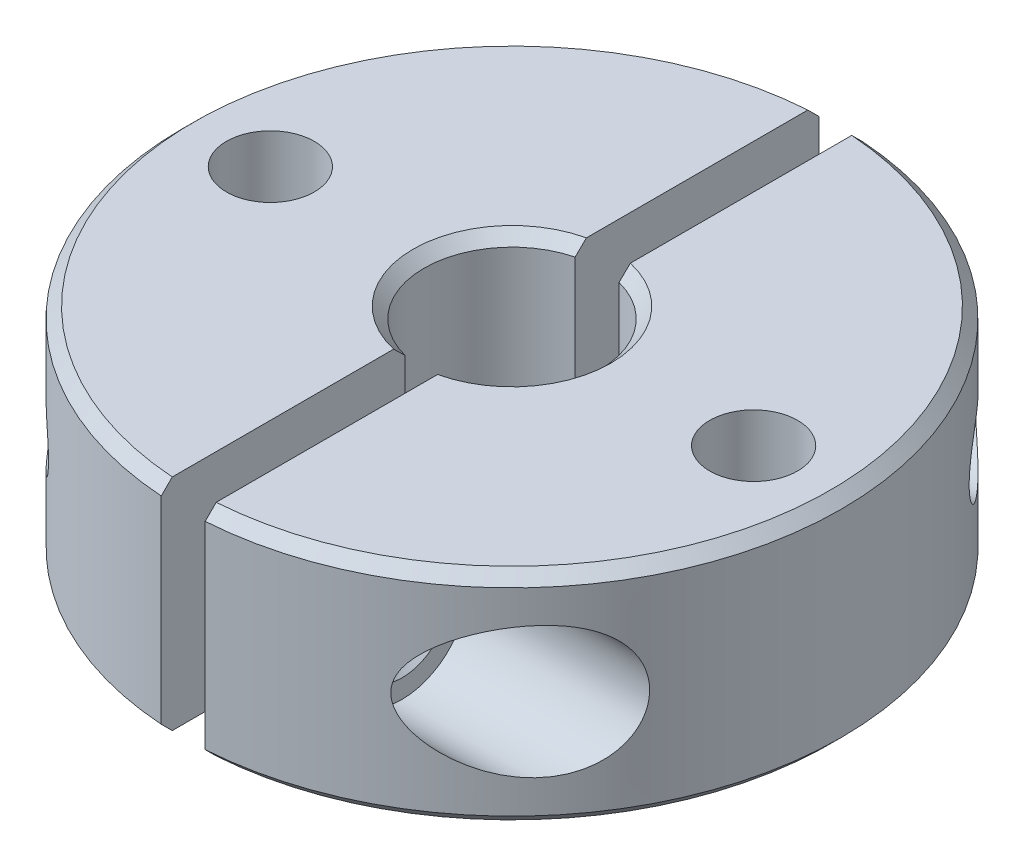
ISO-10303-21;
HEADER;
FILE_DESCRIPTION(('STEP AP214'),'2;1');
FILE_NAME('part.step','',(''),(''),'','','');
FILE_SCHEMA(('AUTOMOTIVE_DESIGN { 1 0 10303 214 1 1 1 1 }'));
ENDSEC;
DATA;
#1=APPLICATION_CONTEXT('core data for automotive mechanical design processes');
#2=APPLICATION_PROTOCOL_DEFINITION('international standard','automotive_design',2000,#1);
#3=PRODUCT_CONTEXT('',#1,'mechanical');
#4=PRODUCT('Part','Part','',(#3));
#5=PRODUCT_RELATED_PRODUCT_CATEGORY('part','',(#4));
#6=PRODUCT_DEFINITION_FORMATION('','',#4);
#7=PRODUCT_DEFINITION_CONTEXT('part definition',#1,'design');
#8=PRODUCT_DEFINITION('design','',#6,#7);
#9=PRODUCT_DEFINITION_SHAPE('','',#8);
#10=(LENGTH_UNIT() NAMED_UNIT(*) SI_UNIT(.MILLI.,.METRE.));
#11=(NAMED_UNIT(*) PLANE_ANGLE_UNIT() SI_UNIT($,.RADIAN.));
#12=(NAMED_UNIT(*) SI_UNIT($,.STERADIAN.) SOLID_ANGLE_UNIT());
#13=UNCERTAINTY_MEASURE_WITH_UNIT(LENGTH_MEASURE(1.E-05),#10,'distance_accuracy_value','');
#14=(GEOMETRIC_REPRESENTATION_CONTEXT(3) GLOBAL_UNCERTAINTY_ASSIGNED_CONTEXT((#13)) GLOBAL_UNIT_ASSIGNED_CONTEXT((#10,
#11,#12)) REPRESENTATION_CONTEXT('',''));
#15=CARTESIAN_POINT('',(0.,0.,0.));
#16=DIRECTION('',(0.,0.,1.));
#17=DIRECTION('',(1.,0.,0.));
#18=AXIS2_PLACEMENT_3D('',#15,#16,#17);
#19=CARTESIAN_POINT('',(-15.001,11.,-10.));
#20=DIRECTION('',(1.,0.,0.));
#21=DIRECTION('',(0.,0.,-1.));
#22=AXIS2_PLACEMENT_3D('',#19,#20,#21);
#23=CYLINDRICAL_SURFACE('',#22,1.65);
#24=CARTESIAN_POINT('',(-4.50000000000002,11.,-10.));
#25=DIRECTION('',(-1.,0.,0.));
#26=DIRECTION('',(0.,0.,1.));
#27=AXIS2_PLACEMENT_3D('',#24,#25,#26);
#28=CIRCLE('',#27,1.65);
#29=CARTESIAN_POINT('',(-4.50000000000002,11.,-11.65));
#30=VERTEX_POINT('',#29);
#31=EDGE_CURVE('E472',#30,#30,#28,.T.);
#32=CARTESIAN_POINT('',(-0.999999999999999,11.,-10.));
#33=DIRECTION('',(1.,0.,0.));
#34=DIRECTION('',(0.,0.,-1.));
#35=AXIS2_PLACEMENT_3D('',#32,#33,#34);
#36=CIRCLE('',#35,1.65);
#37=CARTESIAN_POINT('',(-1.,11.,-11.65));
#38=VERTEX_POINT('',#37);
#39=EDGE_CURVE('E205',#38,#38,#36,.F.);
#40=CARTESIAN_POINT('',(-4.50000000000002,11.,-11.65));
#41=CARTESIAN_POINT('',(-4.46354166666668,11.,-11.65));
#42=CARTESIAN_POINT('',(-4.42708333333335,11.,-11.65));
#43=CARTESIAN_POINT('',(-4.35416666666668,11.,-11.65));
#44=CARTESIAN_POINT('',(-4.31770833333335,11.,-11.65));
#45=CARTESIAN_POINT('',(-4.24479166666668,11.,-11.65));
#46=CARTESIAN_POINT('',(-4.20833333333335,11.,-11.65));
#47=CARTESIAN_POINT('',(-4.13541666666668,11.,-11.65));
#48=CARTESIAN_POINT('',(-4.09895833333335,11.,-11.65));
#49=CARTESIAN_POINT('',(-4.02604166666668,11.,-11.65));
#50=CARTESIAN_POINT('',(-3.98958333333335,11.,-11.65));
#51=CARTESIAN_POINT('',(-3.91666666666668,11.,-11.65));
#52=CARTESIAN_POINT('',(-3.88020833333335,11.,-11.65));
#53=CARTESIAN_POINT('',(-3.80729166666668,11.,-11.65));
#54=CARTESIAN_POINT('',(-3.77083333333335,11.,-11.65));
#55=CARTESIAN_POINT('',(-3.69791666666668,11.,-11.65));
#56=CARTESIAN_POINT('',(-3.66145833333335,11.,-11.65));
#57=CARTESIAN_POINT('',(-3.58854166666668,11.,-11.65));
#58=CARTESIAN_POINT('',(-3.55208333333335,11.,-11.65));
#59=CARTESIAN_POINT('',(-3.47916666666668,11.,-11.65));
#60=CARTESIAN_POINT('',(-3.44270833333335,11.,-11.65));
#61=CARTESIAN_POINT('',(-3.36979166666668,11.,-11.65));
#62=CARTESIAN_POINT('',(-3.33333333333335,11.,-11.65));
#63=CARTESIAN_POINT('',(-3.26041666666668,11.,-11.65));
#64=CARTESIAN_POINT('',(-3.22395833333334,11.,-11.65));
#65=CARTESIAN_POINT('',(-3.15104166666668,11.,-11.65));
#66=CARTESIAN_POINT('',(-3.11458333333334,11.,-11.65));
#67=CARTESIAN_POINT('',(-3.04166666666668,11.,-11.65));
#68=CARTESIAN_POINT('',(-3.00520833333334,11.,-11.65));
#69=CARTESIAN_POINT('',(-2.93229166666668,11.,-11.65));
#70=CARTESIAN_POINT('',(-2.89583333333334,11.,-11.65));
#71=CARTESIAN_POINT('',(-2.82291666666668,11.,-11.65));
#72=CARTESIAN_POINT('',(-2.78645833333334,11.,-11.65));
#73=CARTESIAN_POINT('',(-2.71354166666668,11.,-11.65));
#74=CARTESIAN_POINT('',(-2.67708333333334,11.,-11.65));
#75=CARTESIAN_POINT('',(-2.60416666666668,11.,-11.65));
#76=CARTESIAN_POINT('',(-2.56770833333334,11.,-11.65));
#77=CARTESIAN_POINT('',(-2.49479166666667,11.,-11.65));
#78=CARTESIAN_POINT('',(-2.45833333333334,11.,-11.65));
#79=CARTESIAN_POINT('',(-2.38541666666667,11.,-11.65));
#80=CARTESIAN_POINT('',(-2.34895833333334,11.,-11.65));
#81=CARTESIAN_POINT('',(-2.27604166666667,11.,-11.65));
#82=CARTESIAN_POINT('',(-2.23958333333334,11.,-11.65));
#83=CARTESIAN_POINT('',(-2.16666666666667,11.,-11.65));
#84=CARTESIAN_POINT('',(-2.13020833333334,11.,-11.65));
#85=CARTESIAN_POINT('',(-2.05729166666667,11.,-11.65));
#86=CARTESIAN_POINT('',(-2.02083333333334,11.,-11.65));
#87=CARTESIAN_POINT('',(-1.94791666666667,11.,-11.65));
#88=CARTESIAN_POINT('',(-1.91145833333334,11.,-11.65));
#89=CARTESIAN_POINT('',(-1.83854166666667,11.,-11.65));
#90=CARTESIAN_POINT('',(-1.80208333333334,11.,-11.65));
#91=CARTESIAN_POINT('',(-1.72916666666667,11.,-11.65));
#92=CARTESIAN_POINT('',(-1.69270833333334,11.,-11.65));
#93=CARTESIAN_POINT('',(-1.61979166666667,11.,-11.65));
#94=CARTESIAN_POINT('',(-1.58333333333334,11.,-11.65));
#95=CARTESIAN_POINT('',(-1.51041666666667,11.,-11.65));
#96=CARTESIAN_POINT('',(-1.47395833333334,11.,-11.65));
#97=CARTESIAN_POINT('',(-1.40104166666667,11.,-11.65));
#98=CARTESIAN_POINT('',(-1.36458333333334,11.,-11.65));
#99=CARTESIAN_POINT('',(-1.29166666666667,11.,-11.65));
#100=CARTESIAN_POINT('',(-1.25520833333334,11.,-11.65));
#101=CARTESIAN_POINT('',(-1.18229166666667,11.,-11.65));
#102=CARTESIAN_POINT('',(-1.14583333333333,11.,-11.65));
#103=CARTESIAN_POINT('',(-1.07291666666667,11.,-11.65));
#104=CARTESIAN_POINT('',(-1.03645833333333,11.,-11.65));
#105=CARTESIAN_POINT('',(-1.,11.,-11.65));
#106=B_SPLINE_CURVE_WITH_KNOTS('',3,(#40,#41,#42,#43,#44,#45,#46,#47,#48,#49,#50,#51,#52,#53,
#54,#55,#56,#57,#58,#59,#60,#61,#62,#63,#64,#65,#66,#67,#68,#69,#70,#71,#72,#73,#74,#75,#76,#77,
#78,#79,#80,#81,#82,#83,#84,#85,#86,#87,#88,#89,#90,#91,#92,#93,#94,#95,#96,#97,#98,#99,#100,
#101,#102,#103,#104,#105),.UNSPECIFIED.,.F.,.F.,(4,2,2,2,2,2,2,2,2,2,2,2,2,2,2,2,2,2,2,2,2,2,2,
2,2,2,2,2,2,2,2,2,4),(0.,0.109375,0.21875,0.328125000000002,0.437500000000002,0.546875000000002,
0.656250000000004,0.765625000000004,0.875000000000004,0.984375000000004,1.09375,
1.20312500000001,1.31250000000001,1.42187500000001,1.53125000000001,1.64062500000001,
1.75000000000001,1.85937500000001,1.96875000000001,2.07812500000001,2.18750000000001,
2.29687500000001,2.40625000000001,2.51562500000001,2.62500000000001,2.73437500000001,
2.84375000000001,2.95312500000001,3.06250000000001,3.17187500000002,3.28125000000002,
3.39062500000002,3.50000000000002),.UNSPECIFIED.);
#107=EDGE_CURVE('BSEAM33',#30,#38,#106,.T.);
#108=ORIENTED_EDGE('',*,*,#31,.T.);
#109=ORIENTED_EDGE('',*,*,#39,.F.);
#110=ORIENTED_EDGE('',*,*,#107,.T.);
#111=ORIENTED_EDGE('',*,*,#107,.F.);
#112=EDGE_LOOP('',(#108,#110,#109,#111));
#113=FACE_BOUND('',#112,.T.);
#114=ADVANCED_FACE('F33',(#113),#23,.F.);
#115=CARTESIAN_POINT('',(0.,0.,0.));
#116=DIRECTION('',(0.,-1.,0.));
#117=DIRECTION('',(0.,0.,-1.));
#118=AXIS2_PLACEMENT_3D('',#115,#116,#117);
#119=CYLINDRICAL_SURFACE('',#118,15.);
#120=CARTESIAN_POINT('',(12.4610392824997,11.,-8.35));
#121=CARTESIAN_POINT('',(12.4610365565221,11.0806059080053,-8.35000521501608));
#122=CARTESIAN_POINT('',(12.4570609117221,11.1613100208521,-8.35594656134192));
#123=CARTESIAN_POINT('',(12.4413028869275,11.3203234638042,-8.37938970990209));
#124=CARTESIAN_POINT('',(12.429505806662,11.3986279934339,-8.39691328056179));
#125=CARTESIAN_POINT('',(12.398617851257,11.550265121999,-8.44245356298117));
#126=CARTESIAN_POINT('',(12.3795535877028,11.6236147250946,-8.4704319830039));
#127=CARTESIAN_POINT('',(12.3348105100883,11.763933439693,-8.53545544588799));
#128=CARTESIAN_POINT('',(12.3091327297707,11.8309035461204,-8.57249907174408));
#129=CARTESIAN_POINT('',(12.2504510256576,11.960662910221,-8.65616458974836));
#130=CARTESIAN_POINT('',(12.2171346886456,12.0230515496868,-8.7031854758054));
#131=CARTESIAN_POINT('',(12.1449914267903,12.1388406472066,-8.80357924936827));
#132=CARTESIAN_POINT('',(12.1061625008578,12.1922378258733,-8.85695444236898));
#133=CARTESIAN_POINT('',(12.0175310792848,12.2973572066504,-8.97693230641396));
#134=CARTESIAN_POINT('',(11.966959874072,12.3475486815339,-9.04430502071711));
#135=CARTESIAN_POINT('',(11.8608969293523,12.4358692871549,-9.18296137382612));
#136=CARTESIAN_POINT('',(11.805400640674,12.4739871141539,-9.25424860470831));
#137=CARTESIAN_POINT('',(11.6633777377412,12.5539554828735,-9.43313438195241));
#138=CARTESIAN_POINT('',(11.5745809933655,12.5890569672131,-9.5419720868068));
#139=CARTESIAN_POINT('',(11.3914298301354,12.6362523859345,-9.75990209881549));
#140=CARTESIAN_POINT('',(11.2970687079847,12.6483179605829,-9.86899455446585));
#141=CARTESIAN_POINT('',(11.1039375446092,12.6513730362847,-10.0858274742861));
#142=CARTESIAN_POINT('',(11.0051275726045,12.6421017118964,-10.1935348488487));
#143=CARTESIAN_POINT('',(10.8061595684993,12.6033076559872,-10.4042260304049));
#144=CARTESIAN_POINT('',(10.7059999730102,12.5737590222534,-10.5072036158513));
#145=CARTESIAN_POINT('',(10.5481003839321,12.5113132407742,-10.6651029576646));
#146=CARTESIAN_POINT('',(10.4899705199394,12.4848702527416,-10.7222653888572));
#147=CARTESIAN_POINT('',(10.3745941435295,12.4251518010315,-10.833938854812));
#148=CARTESIAN_POINT('',(10.317347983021,12.3918736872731,-10.8884488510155));
#149=CARTESIAN_POINT('',(10.2045673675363,12.3183985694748,-10.9942153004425));
#150=CARTESIAN_POINT('',(10.1490295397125,12.2782163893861,-11.0454784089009));
#151=CARTESIAN_POINT('',(10.0404667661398,12.1906032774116,-11.1442543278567));
#152=CARTESIAN_POINT('',(9.98743958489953,12.1431789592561,-11.1917705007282));
#153=CARTESIAN_POINT('',(9.88209299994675,12.0376493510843,-11.2849216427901));
#154=CARTESIAN_POINT('',(9.82999126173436,11.9790854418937,-11.3302895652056));
#155=CARTESIAN_POINT('',(9.73201181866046,11.8528038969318,-11.4145567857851));
#156=CARTESIAN_POINT('',(9.6861247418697,11.7851003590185,-11.4534658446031));
#157=CARTESIAN_POINT('',(9.61204791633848,11.6552394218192,-11.5156579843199));
#158=CARTESIAN_POINT('',(9.58216001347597,11.5948168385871,-11.5405087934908));
#159=CARTESIAN_POINT('',(9.53014465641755,11.4684636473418,-11.5835005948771));
#160=CARTESIAN_POINT('',(9.50800642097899,11.4025408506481,-11.6016509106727));
#161=CARTESIAN_POINT('',(9.47629569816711,11.2773962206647,-11.627560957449));
#162=CARTESIAN_POINT('',(9.46527796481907,11.218793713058,-11.6365197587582));
#163=CARTESIAN_POINT('',(9.45109466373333,11.1000319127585,-11.6480426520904));
#164=CARTESIAN_POINT('',(9.44792384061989,11.039873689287,-11.6506110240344));
#165=CARTESIAN_POINT('',(9.44973537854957,10.919727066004,-11.6491416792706));
#166=CARTESIAN_POINT('',(9.45472286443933,10.8597387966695,-11.6450998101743));
#167=CARTESIAN_POINT('',(9.47238065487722,10.74167767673,-11.6307407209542));
#168=CARTESIAN_POINT('',(9.48505655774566,10.6836062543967,-11.6204189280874));
#169=CARTESIAN_POINT('',(9.52099563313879,10.5567981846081,-11.5910007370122));
#170=CARTESIAN_POINT('',(9.54609373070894,10.4889421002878,-11.5703724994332));
#171=CARTESIAN_POINT('',(9.60424040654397,10.3594111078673,-11.5221523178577));
#172=CARTESIAN_POINT('',(9.63730330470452,10.2977476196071,-11.4945478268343));
#173=CARTESIAN_POINT('',(9.72483615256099,10.1555693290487,-11.4206861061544));
#174=CARTESIAN_POINT('',(9.7823735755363,10.0784667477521,-11.3715298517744));
#175=CARTESIAN_POINT('',(9.90486177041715,9.93692303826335,-11.2650062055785));
#176=CARTESIAN_POINT('',(9.96982815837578,9.87250938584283,-11.2076214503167));
#177=CARTESIAN_POINT('',(10.1339847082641,9.72953886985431,-11.05980421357));
#178=CARTESIAN_POINT('',(10.2356165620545,9.65730212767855,-10.9659703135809));
#179=CARTESIAN_POINT('',(10.4429357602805,9.53542290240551,-10.7687363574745));
#180=CARTESIAN_POINT('',(10.5486271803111,9.48580380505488,-10.6653265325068));
#181=CARTESIAN_POINT('',(10.7632492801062,9.40793548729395,-10.4487430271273));
#182=CARTESIAN_POINT('',(10.8721979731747,9.3802122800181,-10.3353977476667));
#183=CARTESIAN_POINT('',(11.0879989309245,9.34910846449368,-10.1035296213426));
#184=CARTESIAN_POINT('',(11.1948526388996,9.34571046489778,-9.98501053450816));
#185=CARTESIAN_POINT('',(11.3897825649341,9.3639814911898,-9.76175345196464));
#186=CARTESIAN_POINT('',(11.4784647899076,9.38237354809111,-9.65728137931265));
#187=CARTESIAN_POINT('',(11.6500462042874,9.44078912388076,-9.44957548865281));
#188=CARTESIAN_POINT('',(11.7329516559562,9.48078879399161,-9.34634043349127));
#189=CARTESIAN_POINT('',(11.8740455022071,9.57341656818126,-9.16609746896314));
#190=CARTESIAN_POINT('',(11.9337954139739,9.62170906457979,-9.0880883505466));
#191=CARTESIAN_POINT('',(12.0464216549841,9.73354250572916,-8.93825873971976));
#192=CARTESIAN_POINT('',(12.0993065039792,9.79706426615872,-8.86643061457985));
#193=CARTESIAN_POINT('',(12.1883037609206,9.92737626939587,-8.74357123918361));
#194=CARTESIAN_POINT('',(12.2257428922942,9.99186722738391,-8.69106779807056));
#195=CARTESIAN_POINT('',(12.2934435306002,10.1306916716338,-8.59503925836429));
#196=CARTESIAN_POINT('',(12.3237040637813,10.2050264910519,-8.55151537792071));
#197=CARTESIAN_POINT('',(12.3760608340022,10.3625716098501,-8.47556934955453));
#198=CARTESIAN_POINT('',(12.3980972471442,10.4458414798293,-8.44322867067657));
#199=CARTESIAN_POINT('',(12.4326466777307,10.6182322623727,-8.39227417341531));
#200=CARTESIAN_POINT('',(12.4451851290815,10.7073368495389,-8.37362369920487));
#201=CARTESIAN_POINT('',(12.4554647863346,10.8311326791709,-8.35831396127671));
#202=CARTESIAN_POINT('',(12.4575526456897,10.8647912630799,-8.35520125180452));
#203=CARTESIAN_POINT('',(12.4603404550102,10.9322941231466,-8.35104319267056));
#204=CARTESIAN_POINT('',(12.4610404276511,10.9661383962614,-8.34999780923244));
#205=CARTESIAN_POINT('',(12.4610392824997,11.,-8.35));
#206=B_SPLINE_CURVE_WITH_KNOTS('',3,(#120,#121,#122,#123,#124,#125,#126,#127,#128,#129,#130,
#131,#132,#133,#134,#135,#136,#137,#138,#139,#140,#141,#142,#143,#144,#145,#146,#147,#148,#149,
#150,#151,#152,#153,#154,#155,#156,#157,#158,#159,#160,#161,#162,#163,#164,#165,#166,#167,#168,
#169,#170,#171,#172,#173,#174,#175,#176,#177,#178,#179,#180,#181,#182,#183,#184,#185,#186,#187,
#188,#189,#190,#191,#192,#193,#194,#195,#196,#197,#198,#199,#200,#201,#202,#203,#204,#205),
.UNSPECIFIED.,.T.,.F.,(4,2,2,2,2,2,2,2,2,2,2,2,2,2,2,2,2,2,2,2,2,2,2,2,2,2,2,2,2,2,2,2,2,2,2,2,
2,2,2,2,2,2,4),(0.,0.241679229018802,0.483813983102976,0.725070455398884,0.966289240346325,
1.22009738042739,1.47399789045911,1.76708884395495,2.06045339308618,2.49245742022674,
2.92499294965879,3.36284389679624,3.80125519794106,4.05811131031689,4.31506719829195,
4.57147810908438,4.82765624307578,5.09862650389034,5.36918347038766,5.58395423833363,
5.79842502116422,5.9785230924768,6.15850051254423,6.33859103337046,6.51881284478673,
6.74326796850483,6.96812969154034,7.29044508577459,7.61345090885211,8.07912950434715,
8.54528850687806,9.02233179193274,9.49903398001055,9.91227239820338,10.3250556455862,
10.6522856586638,10.9791056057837,11.2515888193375,11.5241089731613,11.7985745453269,
12.0723025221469,12.1738308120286,12.2753574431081),.UNSPECIFIED.);
#207=CARTESIAN_POINT('',(12.4610392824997,11.,-8.35));
#208=VERTEX_POINT('',#207);
#209=EDGE_CURVE('E237',#208,#208,#206,.T.);
#210=ORIENTED_EDGE('',*,*,#209,.T.);
#211=EDGE_LOOP('',(#210));
#212=FACE_BOUND('',#211,.T.);
#213=DIRECTION('',(0.,-1.,0.));
#214=VECTOR('',#213,1.);
#215=CARTESIAN_POINT('',(1.,0.,14.9666295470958));
#216=LINE('',#215,#214);
#217=CARTESIAN_POINT('',(1.,15.5,14.9666295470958));
#218=VERTEX_POINT('',#217);
#219=CARTESIAN_POINT('',(1.,6.49999999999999,14.9666295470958));
#220=VERTEX_POINT('',#219);
#221=EDGE_CURVE('E434',#218,#220,#216,.T.);
#222=ORIENTED_EDGE('',*,*,#221,.T.);
#223=CARTESIAN_POINT('',(0.,6.49999999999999,0.));
#224=DIRECTION('',(0.,1.,0.));
#225=DIRECTION('',(0.,0.,1.));
#226=AXIS2_PLACEMENT_3D('',#223,#224,#225);
#227=CIRCLE('',#226,15.);
#228=CARTESIAN_POINT('',(1.,6.49999999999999,-14.9666295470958));
#229=VERTEX_POINT('',#228);
#230=EDGE_CURVE('E418',#220,#229,#227,.T.);
#231=ORIENTED_EDGE('',*,*,#230,.T.);
#232=DIRECTION('',(0.,-1.,0.));
#233=VECTOR('',#232,1.);
#234=CARTESIAN_POINT('',(1.,0.,-14.9666295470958));
#235=LINE('',#234,#233);
#236=CARTESIAN_POINT('',(1.,15.5,-14.9666295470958));
#237=VERTEX_POINT('',#236);
#238=EDGE_CURVE('E403',#229,#237,#235,.F.);
#239=ORIENTED_EDGE('',*,*,#238,.T.);
#240=CARTESIAN_POINT('',(0.,15.5,0.));
#241=DIRECTION('',(0.,-1.,0.));
#242=DIRECTION('',(0.,0.,-1.));
#243=AXIS2_PLACEMENT_3D('',#240,#241,#242);
#244=CIRCLE('',#243,15.);
#245=EDGE_CURVE('E416',#237,#218,#244,.T.);
#246=ORIENTED_EDGE('',*,*,#245,.T.);
#247=EDGE_LOOP('',(#222,#231,#239,#246));
#248=FACE_BOUND('',#247,.T.);
#249=CARTESIAN_POINT('',(7.48331477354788,11.,13.));
#250=CARTESIAN_POINT('',(7.48332836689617,10.9081020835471,12.9999932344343));
#251=CARTESIAN_POINT('',(7.49074685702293,10.8161376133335,12.9957304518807));
#252=CARTESIAN_POINT('',(7.5194779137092,10.63514198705,12.9791257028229));
#253=CARTESIAN_POINT('',(7.54081261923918,10.5461157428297,12.9667708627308));
#254=CARTESIAN_POINT('',(7.60250912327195,10.3492472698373,12.9307169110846));
#255=CARTESIAN_POINT('',(7.64648937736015,10.2429609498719,12.9048328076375));
#256=CARTESIAN_POINT('',(7.74794576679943,10.039797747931,12.8441742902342));
#257=CARTESIAN_POINT('',(7.80545282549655,9.94294315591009,12.8093794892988));
#258=CARTESIAN_POINT('',(7.9186792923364,9.77477248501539,12.7396288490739));
#259=CARTESIAN_POINT('',(7.97292095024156,9.70196693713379,12.7057865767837));
#260=CARTESIAN_POINT('',(8.08601413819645,9.56207749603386,12.6341148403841));
#261=CARTESIAN_POINT('',(8.1448686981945,9.49499742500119,12.5962827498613));
#262=CARTESIAN_POINT('',(8.26603322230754,9.3660131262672,12.5171060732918));
#263=CARTESIAN_POINT('',(8.32834931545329,9.30411859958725,12.4757551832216));
#264=CARTESIAN_POINT('',(8.45546553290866,9.18520322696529,12.3899553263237));
#265=CARTESIAN_POINT('',(8.52026646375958,9.12818398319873,12.345505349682));
#266=CARTESIAN_POINT('',(8.69441238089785,8.9830674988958,12.223937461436));
#267=CARTESIAN_POINT('',(8.8053190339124,8.89887491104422,12.1443740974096));
#268=CARTESIAN_POINT('',(9.02995159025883,8.74181243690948,11.9782941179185));
#269=CARTESIAN_POINT('',(9.14367912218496,8.66894927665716,11.8917734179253));
#270=CARTESIAN_POINT('',(9.37260164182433,8.53402994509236,11.7121954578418));
#271=CARTESIAN_POINT('',(9.48779804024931,8.47198515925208,11.6191314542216));
#272=CARTESIAN_POINT('',(9.7184095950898,8.3587378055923,11.4269438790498));
#273=CARTESIAN_POINT('',(9.83382469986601,8.3075329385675,11.3278215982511));
#274=CARTESIAN_POINT('',(10.0673503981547,8.21487862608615,11.1208587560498));
#275=CARTESIAN_POINT('',(10.1854411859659,8.17375803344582,11.0128480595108));
#276=CARTESIAN_POINT('',(10.4200153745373,8.10387161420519,10.7911690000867));
#277=CARTESIAN_POINT('',(10.5364984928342,8.07510793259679,10.677499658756));
#278=CARTESIAN_POINT('',(10.7667238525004,8.0308850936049,10.4453012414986));
#279=CARTESIAN_POINT('',(10.8804708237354,8.01540109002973,10.3267816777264));
#280=CARTESIAN_POINT('',(11.1044306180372,7.99878518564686,10.0855701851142));
#281=CARTESIAN_POINT('',(11.2146449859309,7.99764692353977,9.96288012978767));
#282=CARTESIAN_POINT('',(11.4748116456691,8.01378403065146,9.66345388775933));
#283=CARTESIAN_POINT('',(11.622586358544,8.03877853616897,9.48513068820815));
#284=CARTESIAN_POINT('',(11.905756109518,8.12390672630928,9.12715291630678));
#285=CARTESIAN_POINT('',(12.0411676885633,8.18399264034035,8.94750048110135));
#286=CARTESIAN_POINT('',(12.2736972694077,8.32894253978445,8.62488684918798));
#287=CARTESIAN_POINT('',(12.3733637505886,8.40760070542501,8.48102348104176));
#288=CARTESIAN_POINT('',(12.5130384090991,8.54601360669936,8.27230014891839));
#289=CARTESIAN_POINT('',(12.5579779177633,8.5955836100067,8.20387384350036));
#290=CARTESIAN_POINT('',(12.6443235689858,8.70153051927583,8.07015453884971));
#291=CARTESIAN_POINT('',(12.6857312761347,8.75790438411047,8.00486015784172));
#292=CARTESIAN_POINT('',(12.7650844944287,8.87783656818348,7.87770818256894));
#293=CARTESIAN_POINT('',(12.8029992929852,8.94144931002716,7.81588265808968));
#294=CARTESIAN_POINT('',(12.874727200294,9.07518827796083,7.69715579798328));
#295=CARTESIAN_POINT('',(12.9085424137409,9.14531112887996,7.64025193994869));
#296=CARTESIAN_POINT('',(12.9718724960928,9.29167854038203,7.53222722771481));
#297=CARTESIAN_POINT('',(13.0013883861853,9.36792164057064,7.48110500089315));
#298=CARTESIAN_POINT('',(13.0559374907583,9.52592398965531,7.38549407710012));
#299=CARTESIAN_POINT('',(13.0809714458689,9.60768232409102,7.34100428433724));
#300=CARTESIAN_POINT('',(13.1431041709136,9.83790588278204,7.22948183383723));
#301=CARTESIAN_POINT('',(13.1755936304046,9.99133433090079,7.16983320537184));
#302=CARTESIAN_POINT('',(13.2260992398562,10.3079801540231,7.07624041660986));
#303=CARTESIAN_POINT('',(13.2441236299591,10.4711918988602,7.04228162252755));
#304=CARTESIAN_POINT('',(13.2646026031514,10.7878988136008,7.0036231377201));
#305=CARTESIAN_POINT('',(13.2682457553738,10.9410473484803,6.99669048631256));
#306=CARTESIAN_POINT('',(13.2632073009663,11.2463828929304,7.00623773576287));
#307=CARTESIAN_POINT('',(13.2545286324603,11.3985701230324,7.0227120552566));
#308=CARTESIAN_POINT('',(13.225275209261,11.69422023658,7.07764219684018));
#309=CARTESIAN_POINT('',(13.2049657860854,11.837801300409,7.11560753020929));
#310=CARTESIAN_POINT('',(13.1528963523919,12.1159489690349,7.21139856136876));
#311=CARTESIAN_POINT('',(13.1211360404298,12.2505153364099,7.26922478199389));
#312=CARTESIAN_POINT('',(13.045628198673,12.5107096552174,7.40389525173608));
#313=CARTESIAN_POINT('',(13.0015960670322,12.6360228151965,7.48118620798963));
#314=CARTESIAN_POINT('',(12.9025967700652,12.8712676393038,7.65066078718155));
#315=CARTESIAN_POINT('',(12.8476269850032,12.9811956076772,7.74284797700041));
#316=CARTESIAN_POINT('',(12.7231189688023,13.1917259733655,7.94590659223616));
#317=CARTESIAN_POINT('',(12.6527968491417,13.2910087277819,8.05766113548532));
#318=CARTESIAN_POINT('',(12.501828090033,13.4692598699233,8.28996389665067));
#319=CARTESIAN_POINT('',(12.4211777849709,13.5482210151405,8.41051523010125));
#320=CARTESIAN_POINT('',(12.2395475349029,13.6953373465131,8.67307389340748));
#321=CARTESIAN_POINT('',(12.1372914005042,13.7606310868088,8.81579319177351));
#322=CARTESIAN_POINT('',(11.9232671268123,13.8669188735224,9.10317785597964));
#323=CARTESIAN_POINT('',(11.8114910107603,13.9078923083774,9.2478447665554));
#324=CARTESIAN_POINT('',(11.6099693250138,13.9598628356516,9.49881820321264));
#325=CARTESIAN_POINT('',(11.5218894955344,13.9758435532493,9.60548417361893));
#326=CARTESIAN_POINT('',(11.3422094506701,13.996298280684,9.81700226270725));
#327=CARTESIAN_POINT('',(11.2506078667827,14.0007677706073,9.92185365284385));
#328=CARTESIAN_POINT('',(11.0644809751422,13.9990167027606,10.1290019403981));
#329=CARTESIAN_POINT('',(10.969952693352,13.9927848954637,10.2312960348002));
#330=CARTESIAN_POINT('',(10.7786462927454,13.970367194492,10.4326445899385));
#331=CARTESIAN_POINT('',(10.6818678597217,13.9541799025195,10.5316985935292));
#332=CARTESIAN_POINT('',(10.4850382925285,13.9121574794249,10.7277014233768));
#333=CARTESIAN_POINT('',(10.3849595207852,13.8861689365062,10.8245893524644));
#334=CARTESIAN_POINT('',(10.1836744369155,13.8251333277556,11.0141674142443));
#335=CARTESIAN_POINT('',(10.0824685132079,13.7900892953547,11.1068589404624));
#336=CARTESIAN_POINT('',(9.87936788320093,13.7112873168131,11.2878968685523));
#337=CARTESIAN_POINT('',(9.77747257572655,13.6675204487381,11.3762387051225));
#338=CARTESIAN_POINT('',(9.57372579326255,13.5715158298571,11.5482268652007));
#339=CARTESIAN_POINT('',(9.47187431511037,13.5192788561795,11.6318736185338));
#340=CARTESIAN_POINT('',(9.27350630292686,13.4088970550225,11.790567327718));
#341=CARTESIAN_POINT('',(9.17695646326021,13.3511252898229,11.8658320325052));
#342=CARTESIAN_POINT('',(8.98528596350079,13.2276657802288,12.0116249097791));
#343=CARTESIAN_POINT('',(8.89016566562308,13.1619760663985,12.0821518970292));
#344=CARTESIAN_POINT('',(8.70266262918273,13.0224685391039,12.2178973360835));
#345=CARTESIAN_POINT('',(8.61027274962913,12.9486748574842,12.2831305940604));
#346=CARTESIAN_POINT('',(8.42940856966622,12.79215405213,12.4079459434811));
#347=CARTESIAN_POINT('',(8.34093134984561,12.7094337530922,12.467532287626));
#348=CARTESIAN_POINT('',(8.17455109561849,12.5387437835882,12.5772051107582));
#349=CARTESIAN_POINT('',(8.09633465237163,12.4513046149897,12.6276320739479));
#350=CARTESIAN_POINT('',(7.9477887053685,12.2662642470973,12.7216500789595));
#351=CARTESIAN_POINT('',(7.87746964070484,12.1686499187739,12.7652321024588));
#352=CARTESIAN_POINT('',(7.74795319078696,11.9605712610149,12.8442614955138));
#353=CARTESIAN_POINT('',(7.6889394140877,11.8499354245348,12.8795763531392));
#354=CARTESIAN_POINT('',(7.61474779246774,11.6758730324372,12.9234846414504));
#355=CARTESIAN_POINT('',(7.59243009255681,11.6166035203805,12.9365961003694));
#356=CARTESIAN_POINT('',(7.55341702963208,11.4956331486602,12.9594135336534));
#357=CARTESIAN_POINT('',(7.53671632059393,11.4339346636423,12.9691227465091));
#358=CARTESIAN_POINT('',(7.51019284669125,11.3106340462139,12.9844998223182));
#359=CARTESIAN_POINT('',(7.50016937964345,11.2490905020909,12.990285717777));
#360=CARTESIAN_POINT('',(7.48672530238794,11.125041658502,12.99803834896));
#361=CARTESIAN_POINT('',(7.48330552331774,11.0625362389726,13.0000046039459));
#362=CARTESIAN_POINT('',(7.48331477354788,11.,13.));
#363=B_SPLINE_CURVE_WITH_KNOTS('',3,(#249,#250,#251,#252,#253,#254,#255,#256,#257,#258,#259,
#260,#261,#262,#263,#264,#265,#266,#267,#268,#269,#270,#271,#272,#273,#274,#275,#276,#277,#278,
#279,#280,#281,#282,#283,#284,#285,#286,#287,#288,#289,#290,#291,#292,#293,#294,#295,#296,#297,
#298,#299,#300,#301,#302,#303,#304,#305,#306,#307,#308,#309,#310,#311,#312,#313,#314,#315,#316,
#317,#318,#319,#320,#321,#322,#323,#324,#325,#326,#327,#328,#329,#330,#331,#332,#333,#334,#335,
#336,#337,#338,#339,#340,#341,#342,#343,#344,#345,#346,#347,#348,#349,#350,#351,#352,#353,#354,
#355,#356,#357,#358,#359,#360,#361,#362),.UNSPECIFIED.,.T.,.F.,(4,2,2,2,2,2,2,2,2,2,2,2,2,2,2,2,
2,2,2,2,2,2,2,2,2,2,2,2,2,2,2,2,2,2,2,2,2,2,2,2,2,2,2,2,2,2,2,2,2,2,2,2,2,2,2,2,4),(0.,
0.275438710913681,0.551316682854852,0.903039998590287,1.25557533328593,1.54585398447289,
1.83632492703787,2.12732767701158,2.41842569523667,2.89883692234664,3.37953227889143,
3.86073051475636,4.34182658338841,4.83698330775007,5.33222594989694,5.82653996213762,
6.32063477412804,7.01675182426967,7.71192343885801,8.28499231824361,8.57179635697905,
8.85847267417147,9.14746774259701,9.43631380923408,9.72509115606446,10.0138207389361,
10.5142166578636,11.0143273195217,11.4721139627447,11.9297914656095,12.377421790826,
12.8250639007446,13.2841027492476,13.7432516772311,14.2368702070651,14.730664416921,
15.2905593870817,15.8509281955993,16.2681583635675,16.6855523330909,17.1033853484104,
17.5212770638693,17.9460011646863,18.3705831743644,18.7956017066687,19.2205812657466,
19.6263795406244,20.0322789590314,20.4370008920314,20.8414155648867,21.2238261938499,
21.6067365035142,21.9954182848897,22.1891314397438,22.3826597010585,22.5700712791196,
22.7575064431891),.UNSPECIFIED.);
#364=CARTESIAN_POINT('',(7.48331477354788,11.,13.));
#365=VERTEX_POINT('',#364);
#366=EDGE_CURVE('E198',#365,#365,#363,.T.);
#367=ORIENTED_EDGE('',*,*,#366,.F.);
#368=EDGE_LOOP('',(#367));
#369=FACE_BOUND('',#368,.T.);
#370=ADVANCED_FACE('F212',(#212,#248,#369),#119,.T.);
#371=CARTESIAN_POINT('',(15.001,11.,10.));
#372=DIRECTION('',(-1.,0.,0.));
#373=DIRECTION('',(0.,0.,1.));
#374=AXIS2_PLACEMENT_3D('',#371,#372,#373);
#375=CYLINDRICAL_SURFACE('',#374,1.65);
#376=CARTESIAN_POINT('',(4.49999999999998,11.,10.));
#377=DIRECTION('',(1.,0.,0.));
#378=DIRECTION('',(0.,0.,-1.));
#379=AXIS2_PLACEMENT_3D('',#376,#377,#378);
#380=CIRCLE('',#379,1.65);
#381=CARTESIAN_POINT('',(4.49999999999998,11.,11.65));
#382=VERTEX_POINT('',#381);
#383=EDGE_CURVE('E463',#382,#382,#380,.T.);
#384=CARTESIAN_POINT('',(0.999999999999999,11.,10.));
#385=DIRECTION('',(1.,0.,0.));
#386=DIRECTION('',(0.,0.,-1.));
#387=AXIS2_PLACEMENT_3D('',#384,#385,#386);
#388=CIRCLE('',#387,1.65);
#389=CARTESIAN_POINT('',(0.999999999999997,11.,11.65));
#390=VERTEX_POINT('',#389);
#391=EDGE_CURVE('E254',#390,#390,#388,.T.);
#392=CARTESIAN_POINT('',(4.49999999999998,11.,11.65));
#393=CARTESIAN_POINT('',(4.46354166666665,11.,11.65));
#394=CARTESIAN_POINT('',(4.42708333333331,11.,11.65));
#395=CARTESIAN_POINT('',(4.35416666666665,11.,11.65));
#396=CARTESIAN_POINT('',(4.31770833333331,11.,11.65));
#397=CARTESIAN_POINT('',(4.24479166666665,11.,11.65));
#398=CARTESIAN_POINT('',(4.20833333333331,11.,11.65));
#399=CARTESIAN_POINT('',(4.13541666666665,11.,11.65));
#400=CARTESIAN_POINT('',(4.09895833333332,11.,11.65));
#401=CARTESIAN_POINT('',(4.02604166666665,11.,11.65));
#402=CARTESIAN_POINT('',(3.98958333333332,11.,11.65));
#403=CARTESIAN_POINT('',(3.91666666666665,11.,11.65));
#404=CARTESIAN_POINT('',(3.88020833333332,11.,11.65));
#405=CARTESIAN_POINT('',(3.80729166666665,11.,11.65));
#406=CARTESIAN_POINT('',(3.77083333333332,11.,11.65));
#407=CARTESIAN_POINT('',(3.69791666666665,11.,11.65));
#408=CARTESIAN_POINT('',(3.66145833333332,11.,11.65));
#409=CARTESIAN_POINT('',(3.58854166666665,11.,11.65));
#410=CARTESIAN_POINT('',(3.55208333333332,11.,11.65));
#411=CARTESIAN_POINT('',(3.47916666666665,11.,11.65));
#412=CARTESIAN_POINT('',(3.44270833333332,11.,11.65));
#413=CARTESIAN_POINT('',(3.36979166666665,11.,11.65));
#414=CARTESIAN_POINT('',(3.33333333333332,11.,11.65));
#415=CARTESIAN_POINT('',(3.26041666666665,11.,11.65));
#416=CARTESIAN_POINT('',(3.22395833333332,11.,11.65));
#417=CARTESIAN_POINT('',(3.15104166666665,11.,11.65));
#418=CARTESIAN_POINT('',(3.11458333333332,11.,11.65));
#419=CARTESIAN_POINT('',(3.04166666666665,11.,11.65));
#420=CARTESIAN_POINT('',(3.00520833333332,11.,11.65));
#421=CARTESIAN_POINT('',(2.93229166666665,11.,11.65));
#422=CARTESIAN_POINT('',(2.89583333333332,11.,11.65));
#423=CARTESIAN_POINT('',(2.82291666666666,11.,11.65));
#424=CARTESIAN_POINT('',(2.78645833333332,11.,11.65));
#425=CARTESIAN_POINT('',(2.71354166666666,11.,11.65));
#426=CARTESIAN_POINT('',(2.67708333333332,11.,11.65));
#427=CARTESIAN_POINT('',(2.60416666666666,11.,11.65));
#428=CARTESIAN_POINT('',(2.56770833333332,11.,11.65));
#429=CARTESIAN_POINT('',(2.49479166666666,11.,11.65));
#430=CARTESIAN_POINT('',(2.45833333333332,11.,11.65));
#431=CARTESIAN_POINT('',(2.38541666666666,11.,11.65));
#432=CARTESIAN_POINT('',(2.34895833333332,11.,11.65));
#433=CARTESIAN_POINT('',(2.27604166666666,11.,11.65));
#434=CARTESIAN_POINT('',(2.23958333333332,11.,11.65));
#435=CARTESIAN_POINT('',(2.16666666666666,11.,11.65));
#436=CARTESIAN_POINT('',(2.13020833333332,11.,11.65));
#437=CARTESIAN_POINT('',(2.05729166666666,11.,11.65));
#438=CARTESIAN_POINT('',(2.02083333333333,11.,11.65));
#439=CARTESIAN_POINT('',(1.94791666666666,11.,11.65));
#440=CARTESIAN_POINT('',(1.91145833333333,11.,11.65));
#441=CARTESIAN_POINT('',(1.83854166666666,11.,11.65));
#442=CARTESIAN_POINT('',(1.80208333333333,11.,11.65));
#443=CARTESIAN_POINT('',(1.72916666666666,11.,11.65));
#444=CARTESIAN_POINT('',(1.69270833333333,11.,11.65));
#445=CARTESIAN_POINT('',(1.61979166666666,11.,11.65));
#446=CARTESIAN_POINT('',(1.58333333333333,11.,11.65));
#447=CARTESIAN_POINT('',(1.51041666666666,11.,11.65));
#448=CARTESIAN_POINT('',(1.47395833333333,11.,11.65));
#449=CARTESIAN_POINT('',(1.40104166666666,11.,11.65));
#450=CARTESIAN_POINT('',(1.36458333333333,11.,11.65));
#451=CARTESIAN_POINT('',(1.29166666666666,11.,11.65));
#452=CARTESIAN_POINT('',(1.25520833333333,11.,11.65));
#453=CARTESIAN_POINT('',(1.18229166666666,11.,11.65));
#454=CARTESIAN_POINT('',(1.14583333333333,11.,11.65));
#455=CARTESIAN_POINT('',(1.07291666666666,11.,11.65));
#456=CARTESIAN_POINT('',(1.03645833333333,11.,11.65));
#457=CARTESIAN_POINT('',(0.999999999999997,11.,11.65));
#458=B_SPLINE_CURVE_WITH_KNOTS('',3,(#392,#393,#394,#395,#396,#397,#398,#399,#400,#401,#402,
#403,#404,#405,#406,#407,#408,#409,#410,#411,#412,#413,#414,#415,#416,#417,#418,#419,#420,#421,
#422,#423,#424,#425,#426,#427,#428,#429,#430,#431,#432,#433,#434,#435,#436,#437,#438,#439,#440,
#441,#442,#443,#444,#445,#446,#447,#448,#449,#450,#451,#452,#453,#454,#455,#456,#457),
.UNSPECIFIED.,.F.,.F.,(4,2,2,2,2,2,2,2,2,2,2,2,2,2,2,2,2,2,2,2,2,2,2,2,2,2,2,2,2,2,2,2,4),(0.,
0.109375,0.218749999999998,0.328124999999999,0.437499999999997,0.546874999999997,
0.656249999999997,0.765624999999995,0.874999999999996,0.984374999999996,1.09374999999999,
1.20312499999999,1.31249999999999,1.42187499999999,1.53124999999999,1.64062499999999,
1.74999999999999,1.85937499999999,1.96874999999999,2.07812499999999,2.18749999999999,
2.29687499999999,2.40624999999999,2.51562499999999,2.62499999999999,2.73437499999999,
2.84374999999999,2.95312499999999,3.06249999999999,3.17187499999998,3.28124999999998,
3.39062499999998,3.49999999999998),.UNSPECIFIED.);
#459=EDGE_CURVE('BSEAM263',#382,#390,#458,.T.);
#460=ORIENTED_EDGE('',*,*,#383,.T.);
#461=ORIENTED_EDGE('',*,*,#391,.F.);
#462=ORIENTED_EDGE('',*,*,#459,.T.);
#463=ORIENTED_EDGE('',*,*,#459,.F.);
#464=EDGE_LOOP('',(#460,#462,#461,#463));
#465=FACE_BOUND('',#464,.T.);
#466=ADVANCED_FACE('F263',(#465),#375,.F.);
#467=CARTESIAN_POINT('',(1.,6.,15.));
#468=DIRECTION('',(1.,0.,0.));
#469=DIRECTION('',(0.,0.,-1.));
#470=AXIS2_PLACEMENT_3D('',#467,#468,#469);
#471=PLANE('',#470);
#472=DIRECTION('',(0.,-1.,0.));
#473=VECTOR('',#472,1.);
#474=CARTESIAN_POINT('',(1.,0.,-3.87298334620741));
#475=LINE('',#474,#473);
#476=CARTESIAN_POINT('',(1.,15.5,-3.87298334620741));
#477=VERTEX_POINT('',#476);
#478=CARTESIAN_POINT('',(1.,6.,-3.87298334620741));
#479=VERTEX_POINT('',#478);
#480=EDGE_CURVE('E185',#477,#479,#475,.T.);
#481=ORIENTED_EDGE('',*,*,#480,.F.);
#482=CARTESIAN_POINT('',(1.,15.5,-3.87298334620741));
#483=CARTESIAN_POINT('',(1.,15.5831850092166,-3.95887730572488));
#484=CARTESIAN_POINT('',(1.,15.6664441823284,-4.04469919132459));
#485=CARTESIAN_POINT('',(1.,15.8331108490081,-4.21619880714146));
#486=CARTESIAN_POINT('',(1.,15.916518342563,-4.30187653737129));
#487=CARTESIAN_POINT('',(1.,16.,-4.38748219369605));
#488=B_SPLINE_CURVE_WITH_KNOTS('',3,(#482,#483,#484,#485,#486,#487),.UNSPECIFIED.,.F.,.F.,(4,2,
4),(0.,0.358716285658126,0.71743253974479),.UNSPECIFIED.);
#489=CARTESIAN_POINT('',(1.,16.,-4.38748219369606));
#490=VERTEX_POINT('',#489);
#491=EDGE_CURVE('E354',#477,#490,#488,.T.);
#492=ORIENTED_EDGE('',*,*,#491,.T.);
#493=DIRECTION('',(0.,0.,1.));
#494=VECTOR('',#493,1.);
#495=CARTESIAN_POINT('',(1.,16.,15.));
#496=LINE('',#495,#494);
#497=CARTESIAN_POINT('',(1.,16.,-14.4654761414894));
#498=VERTEX_POINT('',#497);
#499=EDGE_CURVE('E197',#498,#490,#496,.T.);
#500=ORIENTED_EDGE('',*,*,#499,.F.);
#501=CARTESIAN_POINT('',(1.,16.,-14.4654761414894));
#502=CARTESIAN_POINT('',(1.,15.9166699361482,-14.5490049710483));
#503=CARTESIAN_POINT('',(1.,15.8333382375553,-14.6325321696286));
#504=CARTESIAN_POINT('',(1.,15.6666715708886,-14.7995833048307));
#505=CARTESIAN_POINT('',(1.,15.5833366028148,-14.8831072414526));
#506=CARTESIAN_POINT('',(1.,15.5,-14.9666295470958));
#507=B_SPLINE_CURVE_WITH_KNOTS('',3,(#501,#502,#503,#504,#505,#506),.UNSPECIFIED.,.F.,.F.,(4,2,
4),(0.,0.353961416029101,0.707922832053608),.UNSPECIFIED.);
#508=EDGE_CURVE('E383',#498,#237,#507,.T.);
#509=ORIENTED_EDGE('',*,*,#508,.T.);
#510=ORIENTED_EDGE('',*,*,#238,.F.);
#511=CARTESIAN_POINT('',(1.,6.49999999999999,-14.9666295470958));
#512=CARTESIAN_POINT('',(1.,6.41666339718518,-14.8831072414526));
#513=CARTESIAN_POINT('',(1.,6.33332842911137,-14.7995833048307));
#514=CARTESIAN_POINT('',(1.,6.16666176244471,-14.6325321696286));
#515=CARTESIAN_POINT('',(1.,6.08333006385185,-14.5490049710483));
#516=CARTESIAN_POINT('',(1.,6.,-14.4654761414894));
#517=B_SPLINE_CURVE_WITH_KNOTS('',3,(#511,#512,#513,#514,#515,#516),.UNSPECIFIED.,.F.,.F.,(4,2,
4),(0.,0.353961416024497,0.707922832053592),.UNSPECIFIED.);
#518=CARTESIAN_POINT('',(1.,6.,-14.4654761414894));
#519=VERTEX_POINT('',#518);
#520=EDGE_CURVE('E362',#229,#519,#517,.T.);
#521=ORIENTED_EDGE('',*,*,#520,.T.);
#522=DIRECTION('',(0.,0.,-1.));
#523=VECTOR('',#522,1.);
#524=CARTESIAN_POINT('',(1.,6.,15.));
#525=LINE('',#524,#523);
#526=CARTESIAN_POINT('',(1.,6.,-5.91607978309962));
#527=VERTEX_POINT('',#526);
#528=EDGE_CURVE('E155',#527,#519,#525,.T.);
#529=ORIENTED_EDGE('',*,*,#528,.F.);
#530=EDGE_CURVE('E412',#479,#527,#525,.T.);
#531=ORIENTED_EDGE('',*,*,#530,.F.);
#532=EDGE_LOOP('',(#481,#492,#500,#509,#510,#521,#529,#531));
#533=FACE_BOUND('',#532,.T.);
#534=CARTESIAN_POINT('',(0.999999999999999,11.,-10.));
#535=DIRECTION('',(1.,0.,0.));
#536=DIRECTION('',(0.,0.,-1.));
#537=AXIS2_PLACEMENT_3D('',#534,#535,#536);
#538=CIRCLE('',#537,1.65);
#539=CARTESIAN_POINT('',(0.999999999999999,11.,-11.65));
#540=VERTEX_POINT('',#539);
#541=EDGE_CURVE('E244',#540,#540,#538,.T.);
#542=ORIENTED_EDGE('',*,*,#541,.T.);
#543=EDGE_LOOP('',(#542));
#544=FACE_BOUND('',#543,.T.);
#545=ADVANCED_FACE('F266',(#533,#544),#471,.F.);
#546=CARTESIAN_POINT('',(1.,16.,4.38748219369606));
#547=VERTEX_POINT('',#546);
#548=CARTESIAN_POINT('',(1.,16.,14.4654761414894));
#549=VERTEX_POINT('',#548);
#550=EDGE_CURVE('E194',#547,#549,#496,.T.);
#551=ORIENTED_EDGE('',*,*,#550,.F.);
#552=CARTESIAN_POINT('',(1.,16.,4.38748219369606));
#553=CARTESIAN_POINT('',(1.,15.916518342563,4.30187653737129));
#554=CARTESIAN_POINT('',(1.,15.8331108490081,4.21619880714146));
#555=CARTESIAN_POINT('',(1.,15.6664441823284,4.04469919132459));
#556=CARTESIAN_POINT('',(1.,15.5831850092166,3.95887730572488));
#557=CARTESIAN_POINT('',(1.,15.5,3.87298334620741));
#558=B_SPLINE_CURVE_WITH_KNOTS('',3,(#552,#553,#554,#555,#556,#557),.UNSPECIFIED.,.F.,.F.,(4,2,
4),(0.,0.358716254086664,0.71743253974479),.UNSPECIFIED.);
#559=CARTESIAN_POINT('',(1.,15.5,3.87298334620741));
#560=VERTEX_POINT('',#559);
#561=EDGE_CURVE('E378',#547,#560,#558,.T.);
#562=ORIENTED_EDGE('',*,*,#561,.T.);
#563=DIRECTION('',(0.,-1.,0.));
#564=VECTOR('',#563,1.);
#565=CARTESIAN_POINT('',(1.,0.,3.87298334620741));
#566=LINE('',#565,#564);
#567=CARTESIAN_POINT('',(1.,6.,3.87298334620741));
#568=VERTEX_POINT('',#567);
#569=EDGE_CURVE('E182',#568,#560,#566,.F.);
#570=ORIENTED_EDGE('',*,*,#569,.F.);
#571=CARTESIAN_POINT('',(1.,6.,5.91607978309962));
#572=VERTEX_POINT('',#571);
#573=EDGE_CURVE('E415',#572,#568,#525,.T.);
#574=ORIENTED_EDGE('',*,*,#573,.F.);
#575=CARTESIAN_POINT('',(1.,6.,14.4654761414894));
#576=VERTEX_POINT('',#575);
#577=EDGE_CURVE('E414',#576,#572,#525,.T.);
#578=ORIENTED_EDGE('',*,*,#577,.F.);
#579=CARTESIAN_POINT('',(1.,6.,14.4654761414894));
#580=CARTESIAN_POINT('',(1.,6.08333006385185,14.5490049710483));
#581=CARTESIAN_POINT('',(1.,6.16666176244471,14.6325321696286));
#582=CARTESIAN_POINT('',(1.,6.33332842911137,14.7995833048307));
#583=CARTESIAN_POINT('',(1.,6.41666339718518,14.8831072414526));
#584=CARTESIAN_POINT('',(1.,6.49999999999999,14.9666295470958));
#585=B_SPLINE_CURVE_WITH_KNOTS('',3,(#579,#580,#581,#582,#583,#584),.UNSPECIFIED.,.F.,.F.,(4,2,
4),(0.,0.353961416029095,0.707922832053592),.UNSPECIFIED.);
#586=EDGE_CURVE('E384',#576,#220,#585,.T.);
#587=ORIENTED_EDGE('',*,*,#586,.T.);
#588=ORIENTED_EDGE('',*,*,#221,.F.);
#589=CARTESIAN_POINT('',(1.,15.5,14.9666295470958));
#590=CARTESIAN_POINT('',(1.,15.5833366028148,14.8831072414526));
#591=CARTESIAN_POINT('',(1.,15.6666715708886,14.7995833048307));
#592=CARTESIAN_POINT('',(1.,15.8333382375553,14.6325321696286));
#593=CARTESIAN_POINT('',(1.,15.9166699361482,14.5490049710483));
#594=CARTESIAN_POINT('',(1.,16.,14.4654761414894));
#595=B_SPLINE_CURVE_WITH_KNOTS('',3,(#589,#590,#591,#592,#593,#594),.UNSPECIFIED.,.F.,.F.,(4,2,
4),(0.,0.353961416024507,0.707922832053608),.UNSPECIFIED.);
#596=EDGE_CURVE('E479',#218,#549,#595,.T.);
#597=ORIENTED_EDGE('',*,*,#596,.T.);
#598=EDGE_LOOP('',(#551,#562,#570,#574,#578,#587,#588,#597));
#599=FACE_BOUND('',#598,.T.);
#600=ORIENTED_EDGE('',*,*,#391,.T.);
#601=EDGE_LOOP('',(#600));
#602=FACE_BOUND('',#601,.T.);
#603=ADVANCED_FACE('F281',(#599,#602),#471,.F.);
#604=CARTESIAN_POINT('',(0.,6.,6.));
#605=DIRECTION('',(0.,1.,0.));
#606=DIRECTION('',(0.,0.,1.));
#607=AXIS2_PLACEMENT_3D('',#604,#605,#606);
#608=PLANE('',#607);
#609=CARTESIAN_POINT('',(-11.,6.,0.));
#610=DIRECTION('',(0.,1.,0.));
#611=DIRECTION('',(0.,0.,-1.));
#612=AXIS2_PLACEMENT_3D('',#609,#610,#611);
#613=CIRCLE('',#612,2.);
#614=CARTESIAN_POINT('',(-11.,6.,-2.));
#615=VERTEX_POINT('',#614);
#616=EDGE_CURVE('E532',#615,#615,#613,.T.);
#617=ORIENTED_EDGE('',*,*,#616,.T.);
#618=EDGE_LOOP('',(#617));
#619=FACE_BOUND('',#618,.T.);
#620=DIRECTION('',(0.,0.,-1.));
#621=VECTOR('',#620,1.);
#622=CARTESIAN_POINT('',(-1.,6.,15.));
#623=LINE('',#622,#621);
#624=CARTESIAN_POINT('',(-1.,6.,14.4654761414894));
#625=VERTEX_POINT('',#624);
#626=CARTESIAN_POINT('',(-1.,6.,5.91607978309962));
#627=VERTEX_POINT('',#626);
#628=EDGE_CURVE('E145',#625,#627,#623,.T.);
#629=ORIENTED_EDGE('',*,*,#628,.F.);
#630=CARTESIAN_POINT('',(0.,6.,0.));
#631=DIRECTION('',(0.,1.,0.));
#632=DIRECTION('',(0.,0.,1.));
#633=AXIS2_PLACEMENT_3D('',#630,#631,#632);
#634=CIRCLE('',#633,14.5);
#635=CARTESIAN_POINT('',(-1.,6.,-14.4654761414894));
#636=VERTEX_POINT('',#635);
#637=EDGE_CURVE('E422',#625,#636,#634,.F.);
#638=ORIENTED_EDGE('',*,*,#637,.T.);
#639=CARTESIAN_POINT('',(-1.,6.,-5.91607978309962));
#640=VERTEX_POINT('',#639);
#641=EDGE_CURVE('E158',#640,#636,#623,.T.);
#642=ORIENTED_EDGE('',*,*,#641,.F.);
#643=CARTESIAN_POINT('',(0.,6.,0.));
#644=DIRECTION('',(0.,-1.,0.));
#645=DIRECTION('',(0.,0.,-1.));
#646=AXIS2_PLACEMENT_3D('',#643,#644,#645);
#647=CIRCLE('',#646,6.);
#648=EDGE_CURVE('E170',#627,#640,#647,.T.);
#649=ORIENTED_EDGE('',*,*,#648,.F.);
#650=EDGE_LOOP('',(#629,#638,#642,#649));
#651=FACE_BOUND('',#650,.T.);
#652=ADVANCED_FACE('F171',(#619,#651),#608,.F.);
#653=CARTESIAN_POINT('',(-7.48331477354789,11.,-13.));
#654=CARTESIAN_POINT('',(-7.48332836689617,11.0918979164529,-12.9999932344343));
#655=CARTESIAN_POINT('',(-7.49074685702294,11.1838623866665,-12.9957304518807));
#656=CARTESIAN_POINT('',(-7.5194779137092,11.36485801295,-12.9791257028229));
#657=CARTESIAN_POINT('',(-7.54081261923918,11.4538842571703,-12.9667708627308));
#658=CARTESIAN_POINT('',(-7.60250912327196,11.6507527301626,-12.9307169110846));
#659=CARTESIAN_POINT('',(-7.64648937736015,11.7570390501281,-12.9048328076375));
#660=CARTESIAN_POINT('',(-7.74794576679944,11.960202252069,-12.8441742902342));
#661=CARTESIAN_POINT('',(-7.80545282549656,12.0570568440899,-12.8093794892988));
#662=CARTESIAN_POINT('',(-7.9186792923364,12.2252275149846,-12.7396288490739));
#663=CARTESIAN_POINT('',(-7.97292095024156,12.2980330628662,-12.7057865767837));
#664=CARTESIAN_POINT('',(-8.08601413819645,12.4379225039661,-12.6341148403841));
#665=CARTESIAN_POINT('',(-8.14486869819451,12.5050025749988,-12.5962827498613));
#666=CARTESIAN_POINT('',(-8.26603322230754,12.6339868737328,-12.5171060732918));
#667=CARTESIAN_POINT('',(-8.32834931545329,12.6958814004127,-12.4757551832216));
#668=CARTESIAN_POINT('',(-8.45546553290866,12.8147967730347,-12.3899553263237));
#669=CARTESIAN_POINT('',(-8.52026646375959,12.8718160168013,-12.345505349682));
#670=CARTESIAN_POINT('',(-8.69441238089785,13.0169325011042,-12.223937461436));
#671=CARTESIAN_POINT('',(-8.8053190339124,13.1011250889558,-12.1443740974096));
#672=CARTESIAN_POINT('',(-9.02995159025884,13.2581875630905,-11.9782941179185));
#673=CARTESIAN_POINT('',(-9.14367912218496,13.3310507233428,-11.8917734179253));
#674=CARTESIAN_POINT('',(-9.37260164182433,13.4659700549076,-11.7121954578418));
#675=CARTESIAN_POINT('',(-9.48779804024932,13.5280148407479,-11.6191314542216));
#676=CARTESIAN_POINT('',(-9.7184095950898,13.6412621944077,-11.4269438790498));
#677=CARTESIAN_POINT('',(-9.83382469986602,13.6924670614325,-11.3278215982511));
#678=CARTESIAN_POINT('',(-10.0673503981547,13.7851213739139,-11.1208587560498));
#679=CARTESIAN_POINT('',(-10.1854411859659,13.8262419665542,-11.0128480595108));
#680=CARTESIAN_POINT('',(-10.4200153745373,13.8961283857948,-10.7911690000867));
#681=CARTESIAN_POINT('',(-10.5364984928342,13.9248920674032,-10.6774996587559));
#682=CARTESIAN_POINT('',(-10.7667238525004,13.9691149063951,-10.4453012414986));
#683=CARTESIAN_POINT('',(-10.8804708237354,13.9845989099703,-10.3267816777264));
#684=CARTESIAN_POINT('',(-11.1044306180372,14.0012148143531,-10.0855701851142));
#685=CARTESIAN_POINT('',(-11.2146449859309,14.0023530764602,-9.96288012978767));
#686=CARTESIAN_POINT('',(-11.4748116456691,13.9862159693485,-9.66345388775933));
#687=CARTESIAN_POINT('',(-11.622586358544,13.961221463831,-9.48513068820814));
#688=CARTESIAN_POINT('',(-11.905756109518,13.8760932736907,-9.12715291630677));
#689=CARTESIAN_POINT('',(-12.0411676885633,13.8160073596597,-8.94750048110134));
#690=CARTESIAN_POINT('',(-12.2736972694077,13.6710574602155,-8.62488684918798));
#691=CARTESIAN_POINT('',(-12.3733637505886,13.592399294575,-8.48102348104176));
#692=CARTESIAN_POINT('',(-12.5130384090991,13.4539863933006,-8.27230014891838));
#693=CARTESIAN_POINT('',(-12.5579779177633,13.4044163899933,-8.20387384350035));
#694=CARTESIAN_POINT('',(-12.6443235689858,13.2984694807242,-8.07015453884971));
#695=CARTESIAN_POINT('',(-12.6857312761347,13.2420956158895,-8.00486015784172));
#696=CARTESIAN_POINT('',(-12.7650844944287,13.1221634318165,-7.87770818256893));
#697=CARTESIAN_POINT('',(-12.8029992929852,13.0585506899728,-7.81588265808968));
#698=CARTESIAN_POINT('',(-12.874727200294,12.9248117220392,-7.69715579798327));
#699=CARTESIAN_POINT('',(-12.9085424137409,12.85468887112,-7.64025193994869));
#700=CARTESIAN_POINT('',(-12.9718724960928,12.708321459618,-7.53222722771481));
#701=CARTESIAN_POINT('',(-13.0013883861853,12.6320783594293,-7.48110500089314));
#702=CARTESIAN_POINT('',(-13.0559374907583,12.4740760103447,-7.38549407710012));
#703=CARTESIAN_POINT('',(-13.0809714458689,12.392317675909,-7.34100428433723));
#704=CARTESIAN_POINT('',(-13.1431041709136,12.162094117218,-7.22948183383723));
#705=CARTESIAN_POINT('',(-13.1755936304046,12.0086656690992,-7.16983320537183));
#706=CARTESIAN_POINT('',(-13.2260992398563,11.6920198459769,-7.07624041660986));
#707=CARTESIAN_POINT('',(-13.2441236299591,11.5288081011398,-7.04228162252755));
#708=CARTESIAN_POINT('',(-13.2646026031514,11.2121011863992,-7.0036231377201));
#709=CARTESIAN_POINT('',(-13.2682457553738,11.0589526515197,-6.99669048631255));
#710=CARTESIAN_POINT('',(-13.2632073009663,10.7536171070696,-7.00623773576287));
#711=CARTESIAN_POINT('',(-13.2545286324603,10.6014298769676,-7.0227120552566));
#712=CARTESIAN_POINT('',(-13.225275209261,10.30577976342,-7.07764219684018));
#713=CARTESIAN_POINT('',(-13.2049657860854,10.162198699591,-7.11560753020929));
#714=CARTESIAN_POINT('',(-13.1528963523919,9.88405103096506,-7.21139856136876));
#715=CARTESIAN_POINT('',(-13.1211360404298,9.74948466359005,-7.26922478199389));
#716=CARTESIAN_POINT('',(-13.045628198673,9.48929034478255,-7.40389525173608));
#717=CARTESIAN_POINT('',(-13.0015960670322,9.3639771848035,-7.48118620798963));
#718=CARTESIAN_POINT('',(-12.9025967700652,9.12873236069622,-7.65066078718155));
#719=CARTESIAN_POINT('',(-12.8476269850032,9.01880439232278,-7.74284797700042));
#720=CARTESIAN_POINT('',(-12.7231189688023,8.80827402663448,-7.94590659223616));
#721=CARTESIAN_POINT('',(-12.6527968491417,8.70899127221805,-8.05766113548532));
#722=CARTESIAN_POINT('',(-12.501828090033,8.53074013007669,-8.28996389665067));
#723=CARTESIAN_POINT('',(-12.4211777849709,8.45177898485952,-8.41051523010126));
#724=CARTESIAN_POINT('',(-12.2395475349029,8.30466265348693,-8.67307389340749));
#725=CARTESIAN_POINT('',(-12.1372914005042,8.23936891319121,-8.81579319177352));
#726=CARTESIAN_POINT('',(-11.9232671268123,8.13308112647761,-9.10317785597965));
#727=CARTESIAN_POINT('',(-11.8114910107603,8.09210769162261,-9.2478447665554));
#728=CARTESIAN_POINT('',(-11.6099693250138,8.04013716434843,-9.49881820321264));
#729=CARTESIAN_POINT('',(-11.5218894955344,8.0241564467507,-9.60548417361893));
#730=CARTESIAN_POINT('',(-11.3422094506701,8.00370171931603,-9.81700226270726));
#731=CARTESIAN_POINT('',(-11.2506078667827,7.99923222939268,-9.92185365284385));
#732=CARTESIAN_POINT('',(-11.0644809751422,8.00098329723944,-10.1290019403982));
#733=CARTESIAN_POINT('',(-10.969952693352,8.00721510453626,-10.2312960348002));
#734=CARTESIAN_POINT('',(-10.7786462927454,8.02963280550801,-10.4326445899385));
#735=CARTESIAN_POINT('',(-10.6818678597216,8.04582009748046,-10.5316985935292));
#736=CARTESIAN_POINT('',(-10.4850382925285,8.08784252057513,-10.7277014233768));
#737=CARTESIAN_POINT('',(-10.3849595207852,8.11383106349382,-10.8245893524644));
#738=CARTESIAN_POINT('',(-10.1836744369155,8.1748666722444,-11.0141674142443));
#739=CARTESIAN_POINT('',(-10.0824685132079,8.20991070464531,-11.1068589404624));
#740=CARTESIAN_POINT('',(-9.87936788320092,8.28871268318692,-11.2878968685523));
#741=CARTESIAN_POINT('',(-9.77747257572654,8.33247955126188,-11.3762387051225));
#742=CARTESIAN_POINT('',(-9.57372579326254,8.42848417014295,-11.5482268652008));
#743=CARTESIAN_POINT('',(-9.47187431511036,8.48072114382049,-11.6318736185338));
#744=CARTESIAN_POINT('',(-9.27350630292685,8.59110294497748,-11.790567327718));
#745=CARTESIAN_POINT('',(-9.1769564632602,8.64887471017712,-11.8658320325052));
#746=CARTESIAN_POINT('',(-8.98528596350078,8.77233421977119,-12.0116249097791));
#747=CARTESIAN_POINT('',(-8.89016566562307,8.83802393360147,-12.0821518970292));
#748=CARTESIAN_POINT('',(-8.70266262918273,8.97753146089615,-12.2178973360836));
#749=CARTESIAN_POINT('',(-8.61027274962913,9.05132514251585,-12.2831305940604));
#750=CARTESIAN_POINT('',(-8.42940856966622,9.20784594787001,-12.4079459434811));
#751=CARTESIAN_POINT('',(-8.34093134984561,9.29056624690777,-12.467532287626));
#752=CARTESIAN_POINT('',(-8.17455109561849,9.46125621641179,-12.5772051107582));
#753=CARTESIAN_POINT('',(-8.09633465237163,9.54869538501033,-12.6276320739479));
#754=CARTESIAN_POINT('',(-7.9477887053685,9.73373575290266,-12.7216500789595));
#755=CARTESIAN_POINT('',(-7.87746964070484,9.83135008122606,-12.7652321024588));
#756=CARTESIAN_POINT('',(-7.74795319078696,10.0394287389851,-12.8442614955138));
#757=CARTESIAN_POINT('',(-7.6889394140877,10.1500645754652,-12.8795763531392));
#758=CARTESIAN_POINT('',(-7.61474779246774,10.3241269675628,-12.9234846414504));
#759=CARTESIAN_POINT('',(-7.59243009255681,10.3833964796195,-12.9365961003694));
#760=CARTESIAN_POINT('',(-7.55341702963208,10.5043668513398,-12.9594135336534));
#761=CARTESIAN_POINT('',(-7.53671632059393,10.5660653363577,-12.9691227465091));
#762=CARTESIAN_POINT('',(-7.51019284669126,10.6893659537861,-12.9844998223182));
#763=CARTESIAN_POINT('',(-7.50016937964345,10.7509094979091,-12.990285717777));
#764=CARTESIAN_POINT('',(-7.48672530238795,10.874958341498,-12.99803834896));
#765=CARTESIAN_POINT('',(-7.48330552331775,10.9374637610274,-13.0000046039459));
#766=CARTESIAN_POINT('',(-7.48331477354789,11.,-13.));
#767=B_SPLINE_CURVE_WITH_KNOTS('',3,(#653,#654,#655,#656,#657,#658,#659,#660,#661,#662,#663,
#664,#665,#666,#667,#668,#669,#670,#671,#672,#673,#674,#675,#676,#677,#678,#679,#680,#681,#682,
#683,#684,#685,#686,#687,#688,#689,#690,#691,#692,#693,#694,#695,#696,#697,#698,#699,#700,#701,
#702,#703,#704,#705,#706,#707,#708,#709,#710,#711,#712,#713,#714,#715,#716,#717,#718,#719,#720,
#721,#722,#723,#724,#725,#726,#727,#728,#729,#730,#731,#732,#733,#734,#735,#736,#737,#738,#739,
#740,#741,#742,#743,#744,#745,#746,#747,#748,#749,#750,#751,#752,#753,#754,#755,#756,#757,#758,
#759,#760,#761,#762,#763,#764,#765,#766),.UNSPECIFIED.,.T.,.F.,(4,2,2,2,2,2,2,2,2,2,2,2,2,2,2,2,
2,2,2,2,2,2,2,2,2,2,2,2,2,2,2,2,2,2,2,2,2,2,2,2,2,2,2,2,2,2,2,2,2,2,2,2,2,2,2,2,4),(0.,
0.275438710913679,0.551316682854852,0.903039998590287,1.25557533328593,1.54585398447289,
1.83632492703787,2.12732767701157,2.41842569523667,2.89883692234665,3.37953227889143,
3.86073051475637,4.34182658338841,4.83698330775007,5.33222594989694,5.82653996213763,
6.32063477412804,7.01675182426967,7.71192343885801,8.28499231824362,8.57179635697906,
8.85847267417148,9.14746774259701,9.43631380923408,9.72509115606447,10.0138207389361,
10.5142166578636,11.0143273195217,11.4721139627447,11.9297914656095,12.377421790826,
12.8250639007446,13.2841027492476,13.7432516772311,14.2368702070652,14.730664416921,
15.2905593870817,15.8509281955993,16.2681583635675,16.6855523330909,17.1033853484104,
17.5212770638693,17.9460011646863,18.3705831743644,18.7956017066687,19.2205812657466,
19.6263795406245,20.0322789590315,20.4370008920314,20.8414155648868,21.2238261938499,
21.6067365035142,21.9954182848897,22.1891314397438,22.3826597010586,22.5700712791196,
22.7575064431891),.UNSPECIFIED.);
#768=CARTESIAN_POINT('',(-7.48331477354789,11.,-13.));
#769=VERTEX_POINT('',#768);
#770=EDGE_CURVE('E207',#769,#769,#767,.T.);
#771=ORIENTED_EDGE('',*,*,#770,.T.);
#772=EDGE_LOOP('',(#771));
#773=FACE_BOUND('',#772,.T.);
#774=CARTESIAN_POINT('',(-12.4610392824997,11.,8.35));
#775=CARTESIAN_POINT('',(-12.4610365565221,10.9193940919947,8.35000521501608));
#776=CARTESIAN_POINT('',(-12.4570609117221,10.8386899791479,8.35594656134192));
#777=CARTESIAN_POINT('',(-12.4413028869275,10.6796765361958,8.37938970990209));
#778=CARTESIAN_POINT('',(-12.429505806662,10.6013720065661,8.39691328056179));
#779=CARTESIAN_POINT('',(-12.398617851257,10.449734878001,8.44245356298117));
#780=CARTESIAN_POINT('',(-12.3795535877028,10.3763852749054,8.4704319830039));
#781=CARTESIAN_POINT('',(-12.3348105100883,10.236066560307,8.53545544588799));
#782=CARTESIAN_POINT('',(-12.3091327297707,10.1690964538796,8.57249907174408));
#783=CARTESIAN_POINT('',(-12.2504510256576,10.039337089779,8.65616458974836));
#784=CARTESIAN_POINT('',(-12.2171346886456,9.97694845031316,8.7031854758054));
#785=CARTESIAN_POINT('',(-12.1449914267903,9.86115935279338,8.80357924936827));
#786=CARTESIAN_POINT('',(-12.1061625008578,9.80776217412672,8.85695444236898));
#787=CARTESIAN_POINT('',(-12.0175310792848,9.70264279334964,8.97693230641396));
#788=CARTESIAN_POINT('',(-11.966959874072,9.65245131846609,9.04430502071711));
#789=CARTESIAN_POINT('',(-11.8608969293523,9.56413071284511,9.18296137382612));
#790=CARTESIAN_POINT('',(-11.805400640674,9.52601288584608,9.25424860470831));
#791=CARTESIAN_POINT('',(-11.6633777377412,9.44604451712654,9.43313438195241));
#792=CARTESIAN_POINT('',(-11.5745809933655,9.41094303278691,9.5419720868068));
#793=CARTESIAN_POINT('',(-11.3914298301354,9.36374761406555,9.75990209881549));
#794=CARTESIAN_POINT('',(-11.2970687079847,9.35168203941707,9.86899455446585));
#795=CARTESIAN_POINT('',(-11.1039375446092,9.34862696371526,10.0858274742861));
#796=CARTESIAN_POINT('',(-11.0051275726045,9.35789828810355,10.1935348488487));
#797=CARTESIAN_POINT('',(-10.8061595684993,9.39669234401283,10.4042260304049));
#798=CARTESIAN_POINT('',(-10.7059999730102,9.42624097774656,10.5072036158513));
#799=CARTESIAN_POINT('',(-10.5481003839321,9.48868675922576,10.6651029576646));
#800=CARTESIAN_POINT('',(-10.4899705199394,9.51512974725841,10.7222653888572));
#801=CARTESIAN_POINT('',(-10.3745941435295,9.57484819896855,10.833938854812));
#802=CARTESIAN_POINT('',(-10.317347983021,9.60812631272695,10.8884488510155));
#803=CARTESIAN_POINT('',(-10.2045673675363,9.6816014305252,10.9942153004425));
#804=CARTESIAN_POINT('',(-10.1490295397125,9.72178361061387,11.0454784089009));
#805=CARTESIAN_POINT('',(-10.0404667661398,9.80939672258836,11.1442543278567));
#806=CARTESIAN_POINT('',(-9.98743958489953,9.85682104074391,11.1917705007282));
#807=CARTESIAN_POINT('',(-9.88209299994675,9.96235064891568,11.2849216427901));
#808=CARTESIAN_POINT('',(-9.82999126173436,10.0209145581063,11.3302895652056));
#809=CARTESIAN_POINT('',(-9.73201181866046,10.1471961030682,11.4145567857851));
#810=CARTESIAN_POINT('',(-9.6861247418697,10.2148996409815,11.4534658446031));
#811=CARTESIAN_POINT('',(-9.61204791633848,10.3447605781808,11.5156579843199));
#812=CARTESIAN_POINT('',(-9.58216001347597,10.4051831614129,11.5405087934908));
#813=CARTESIAN_POINT('',(-9.53014465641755,10.5315363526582,11.5835005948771));
#814=CARTESIAN_POINT('',(-9.50800642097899,10.5974591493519,11.6016509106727));
#815=CARTESIAN_POINT('',(-9.47629569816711,10.7226037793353,11.627560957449));
#816=CARTESIAN_POINT('',(-9.46527796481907,10.781206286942,11.6365197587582));
#817=CARTESIAN_POINT('',(-9.45109466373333,10.8999680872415,11.6480426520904));
#818=CARTESIAN_POINT('',(-9.44792384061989,10.960126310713,11.6506110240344));
#819=CARTESIAN_POINT('',(-9.44973537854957,11.080272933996,11.6491416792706));
#820=CARTESIAN_POINT('',(-9.45472286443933,11.1402612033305,11.6450998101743));
#821=CARTESIAN_POINT('',(-9.47238065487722,11.25832232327,11.6307407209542));
#822=CARTESIAN_POINT('',(-9.48505655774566,11.3163937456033,11.6204189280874));
#823=CARTESIAN_POINT('',(-9.52099563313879,11.4432018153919,11.5910007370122));
#824=CARTESIAN_POINT('',(-9.54609373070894,11.5110578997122,11.5703724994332));
#825=CARTESIAN_POINT('',(-9.60424040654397,11.6405888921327,11.5221523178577));
#826=CARTESIAN_POINT('',(-9.63730330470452,11.7022523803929,11.4945478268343));
#827=CARTESIAN_POINT('',(-9.72483615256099,11.8444306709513,11.4206861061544));
#828=CARTESIAN_POINT('',(-9.7823735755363,11.9215332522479,11.3715298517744));
#829=CARTESIAN_POINT('',(-9.90486177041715,12.0630769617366,11.2650062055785));
#830=CARTESIAN_POINT('',(-9.96982815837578,12.1274906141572,11.2076214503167));
#831=CARTESIAN_POINT('',(-10.1339847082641,12.2704611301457,11.05980421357));
#832=CARTESIAN_POINT('',(-10.2356165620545,12.3426978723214,10.9659703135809));
#833=CARTESIAN_POINT('',(-10.4429357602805,12.4645770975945,10.7687363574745));
#834=CARTESIAN_POINT('',(-10.5486271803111,12.5141961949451,10.6653265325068));
#835=CARTESIAN_POINT('',(-10.7632492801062,12.592064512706,10.4487430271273));
#836=CARTESIAN_POINT('',(-10.8721979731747,12.6197877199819,10.3353977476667));
#837=CARTESIAN_POINT('',(-11.0879989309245,12.6508915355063,10.1035296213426));
#838=CARTESIAN_POINT('',(-11.1948526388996,12.6542895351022,9.98501053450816));
#839=CARTESIAN_POINT('',(-11.3897825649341,12.6360185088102,9.76175345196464));
#840=CARTESIAN_POINT('',(-11.4784647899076,12.6176264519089,9.65728137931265));
#841=CARTESIAN_POINT('',(-11.6500462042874,12.5592108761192,9.44957548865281));
#842=CARTESIAN_POINT('',(-11.7329516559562,12.5192112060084,9.34634043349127));
#843=CARTESIAN_POINT('',(-11.8740455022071,12.4265834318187,9.16609746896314));
#844=CARTESIAN_POINT('',(-11.9337954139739,12.3782909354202,9.0880883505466));
#845=CARTESIAN_POINT('',(-12.0464216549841,12.2664574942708,8.93825873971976));
#846=CARTESIAN_POINT('',(-12.0993065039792,12.2029357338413,8.86643061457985));
#847=CARTESIAN_POINT('',(-12.1883037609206,12.0726237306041,8.74357123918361));
#848=CARTESIAN_POINT('',(-12.2257428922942,12.0081327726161,8.69106779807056));
#849=CARTESIAN_POINT('',(-12.2934435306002,11.8693083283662,8.59503925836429));
#850=CARTESIAN_POINT('',(-12.3237040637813,11.7949735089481,8.55151537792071));
#851=CARTESIAN_POINT('',(-12.3760608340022,11.6374283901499,8.47556934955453));
#852=CARTESIAN_POINT('',(-12.3980972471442,11.5541585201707,8.44322867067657));
#853=CARTESIAN_POINT('',(-12.4326466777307,11.3817677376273,8.39227417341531));
#854=CARTESIAN_POINT('',(-12.4451851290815,11.2926631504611,8.37362369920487));
#855=CARTESIAN_POINT('',(-12.4554647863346,11.1688673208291,8.35831396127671));
#856=CARTESIAN_POINT('',(-12.4575526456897,11.1352087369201,8.35520125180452));
#857=CARTESIAN_POINT('',(-12.4603404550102,11.0677058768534,8.35104319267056));
#858=CARTESIAN_POINT('',(-12.4610404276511,11.0338616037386,8.34999780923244));
#859=CARTESIAN_POINT('',(-12.4610392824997,11.,8.35));
#860=B_SPLINE_CURVE_WITH_KNOTS('',3,(#774,#775,#776,#777,#778,#779,#780,#781,#782,#783,#784,
#785,#786,#787,#788,#789,#790,#791,#792,#793,#794,#795,#796,#797,#798,#799,#800,#801,#802,#803,
#804,#805,#806,#807,#808,#809,#810,#811,#812,#813,#814,#815,#816,#817,#818,#819,#820,#821,#822,
#823,#824,#825,#826,#827,#828,#829,#830,#831,#832,#833,#834,#835,#836,#837,#838,#839,#840,#841,
#842,#843,#844,#845,#846,#847,#848,#849,#850,#851,#852,#853,#854,#855,#856,#857,#858,#859),
.UNSPECIFIED.,.T.,.F.,(4,2,2,2,2,2,2,2,2,2,2,2,2,2,2,2,2,2,2,2,2,2,2,2,2,2,2,2,2,2,2,2,2,2,2,2,
2,2,2,2,2,2,4),(0.,0.241679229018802,0.483813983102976,0.725070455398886,0.966289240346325,
1.22009738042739,1.47399789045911,1.76708884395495,2.06045339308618,2.49245742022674,
2.92499294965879,3.36284389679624,3.80125519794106,4.05811131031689,4.31506719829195,
4.57147810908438,4.82765624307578,5.09862650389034,5.36918347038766,5.58395423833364,
5.79842502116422,5.9785230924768,6.15850051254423,6.33859103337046,6.51881284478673,
6.74326796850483,6.96812969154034,7.29044508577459,7.61345090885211,8.07912950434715,
8.54528850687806,9.02233179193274,9.49903398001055,9.91227239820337,10.3250556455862,
10.6522856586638,10.9791056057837,11.2515888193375,11.5241089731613,11.7985745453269,
12.0723025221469,12.1738308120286,12.2753574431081),.UNSPECIFIED.);
#861=CARTESIAN_POINT('',(-12.4610392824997,11.,8.35));
#862=VERTEX_POINT('',#861);
#863=EDGE_CURVE('E248',#862,#862,#860,.T.);
#864=ORIENTED_EDGE('',*,*,#863,.F.);
#865=EDGE_LOOP('',(#864));
#866=FACE_BOUND('',#865,.T.);
#867=DIRECTION('',(0.,-1.,0.));
#868=VECTOR('',#867,1.);
#869=CARTESIAN_POINT('',(-1.,0.,-14.9666295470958));
#870=LINE('',#869,#868);
#871=CARTESIAN_POINT('',(-1.,6.49999999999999,-14.9666295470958));
#872=VERTEX_POINT('',#871);
#873=CARTESIAN_POINT('',(-1.,15.5,-14.9666295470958));
#874=VERTEX_POINT('',#873);
#875=EDGE_CURVE('E424',#872,#874,#870,.F.);
#876=ORIENTED_EDGE('',*,*,#875,.F.);
#877=CARTESIAN_POINT('',(0.,6.49999999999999,0.));
#878=DIRECTION('',(0.,1.,0.));
#879=DIRECTION('',(0.,0.,1.));
#880=AXIS2_PLACEMENT_3D('',#877,#878,#879);
#881=CIRCLE('',#880,15.);
#882=CARTESIAN_POINT('',(-1.,6.49999999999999,14.9666295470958));
#883=VERTEX_POINT('',#882);
#884=EDGE_CURVE('E12',#872,#883,#881,.T.);
#885=ORIENTED_EDGE('',*,*,#884,.T.);
#886=DIRECTION('',(0.,-1.,0.));
#887=VECTOR('',#886,1.);
#888=CARTESIAN_POINT('',(-1.,0.,14.9666295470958));
#889=LINE('',#888,#887);
#890=CARTESIAN_POINT('',(-1.,15.5,14.9666295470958));
#891=VERTEX_POINT('',#890);
#892=EDGE_CURVE('E425',#891,#883,#889,.T.);
#893=ORIENTED_EDGE('',*,*,#892,.F.);
#894=CARTESIAN_POINT('',(0.,15.5,0.));
#895=DIRECTION('',(0.,-1.,0.));
#896=DIRECTION('',(0.,0.,-1.));
#897=AXIS2_PLACEMENT_3D('',#894,#895,#896);
#898=CIRCLE('',#897,15.);
#899=EDGE_CURVE('E42',#891,#874,#898,.T.);
#900=ORIENTED_EDGE('',*,*,#899,.T.);
#901=EDGE_LOOP('',(#876,#885,#893,#900));
#902=FACE_BOUND('',#901,.T.);
#903=ADVANCED_FACE('F423',(#773,#866,#902),#119,.T.);
#904=CARTESIAN_POINT('',(0.,16.,15.));
#905=DIRECTION('',(0.,-1.,0.));
#906=DIRECTION('',(0.,0.,-1.));
#907=AXIS2_PLACEMENT_3D('',#904,#905,#906);
#908=PLANE('',#907);
#909=CARTESIAN_POINT('',(-11.,16.,0.));
#910=DIRECTION('',(0.,1.,0.));
#911=DIRECTION('',(0.,0.,-1.));
#912=AXIS2_PLACEMENT_3D('',#909,#910,#911);
#913=CIRCLE('',#912,2.);
#914=CARTESIAN_POINT('',(-11.,16.,-2.));
#915=VERTEX_POINT('',#914);
#916=EDGE_CURVE('E530',#915,#915,#913,.T.);
#917=ORIENTED_EDGE('',*,*,#916,.F.);
#918=EDGE_LOOP('',(#917));
#919=FACE_BOUND('',#918,.T.);
#920=DIRECTION('',(0.,0.,1.));
#921=VECTOR('',#920,1.);
#922=CARTESIAN_POINT('',(-1.,16.,15.));
#923=LINE('',#922,#921);
#924=CARTESIAN_POINT('',(-1.,16.,4.38748219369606));
#925=VERTEX_POINT('',#924);
#926=CARTESIAN_POINT('',(-1.,16.,14.4654761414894));
#927=VERTEX_POINT('',#926);
#928=EDGE_CURVE('E190',#925,#927,#923,.T.);
#929=ORIENTED_EDGE('',*,*,#928,.F.);
#930=CARTESIAN_POINT('',(0.,16.,0.));
#931=DIRECTION('',(0.,-1.,0.));
#932=DIRECTION('',(0.,0.,-1.));
#933=AXIS2_PLACEMENT_3D('',#930,#931,#932);
#934=CIRCLE('',#933,4.49999999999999);
#935=CARTESIAN_POINT('',(-1.,16.,-4.38748219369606));
#936=VERTEX_POINT('',#935);
#937=EDGE_CURVE('E348',#925,#936,#934,.T.);
#938=ORIENTED_EDGE('',*,*,#937,.T.);
#939=CARTESIAN_POINT('',(-1.,16.,-14.4654761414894));
#940=VERTEX_POINT('',#939);
#941=EDGE_CURVE('E193',#940,#936,#923,.T.);
#942=ORIENTED_EDGE('',*,*,#941,.F.);
#943=CARTESIAN_POINT('',(0.,16.,0.));
#944=DIRECTION('',(0.,-1.,0.));
#945=DIRECTION('',(0.,0.,-1.));
#946=AXIS2_PLACEMENT_3D('',#943,#944,#945);
#947=CIRCLE('',#946,14.5);
#948=EDGE_CURVE('E342',#940,#927,#947,.F.);
#949=ORIENTED_EDGE('',*,*,#948,.T.);
#950=EDGE_LOOP('',(#929,#938,#942,#949));
#951=FACE_BOUND('',#950,.T.);
#952=ADVANCED_FACE('F547',(#919,#951),#908,.F.);
#953=CARTESIAN_POINT('',(0.,0.,0.));
#954=DIRECTION('',(0.,-1.,0.));
#955=DIRECTION('',(0.,0.,-1.));
#956=AXIS2_PLACEMENT_3D('',#953,#954,#955);
#957=CYLINDRICAL_SURFACE('',#956,4.);
#958=CARTESIAN_POINT('',(0.,0.499999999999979,0.));
#959=DIRECTION('',(0.,1.,0.));
#960=DIRECTION('',(0.,0.,1.));
#961=AXIS2_PLACEMENT_3D('',#958,#959,#960);
#962=CIRCLE('',#961,4.);
#963=CARTESIAN_POINT('',(0.,0.499999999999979,4.));
#964=VERTEX_POINT('',#963);
#965=EDGE_CURVE('E454',#964,#964,#962,.F.);
#966=ORIENTED_EDGE('',*,*,#965,.T.);
#967=EDGE_LOOP('',(#966));
#968=FACE_BOUND('',#967,.T.);
#969=ORIENTED_EDGE('',*,*,#569,.T.);
#970=CARTESIAN_POINT('',(0.,15.5,0.));
#971=DIRECTION('',(0.,-1.,0.));
#972=DIRECTION('',(0.,0.,-1.));
#973=AXIS2_PLACEMENT_3D('',#970,#971,#972);
#974=CIRCLE('',#973,4.);
#975=EDGE_CURVE('E441',#560,#477,#974,.F.);
#976=ORIENTED_EDGE('',*,*,#975,.T.);
#977=ORIENTED_EDGE('',*,*,#480,.T.);
#978=CARTESIAN_POINT('',(0.,6.,0.));
#979=DIRECTION('',(0.,1.,0.));
#980=DIRECTION('',(0.,0.,1.));
#981=AXIS2_PLACEMENT_3D('',#978,#979,#980);
#982=CIRCLE('',#981,4.);
#983=CARTESIAN_POINT('',(-1.,6.,-3.87298334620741));
#984=VERTEX_POINT('',#983);
#985=EDGE_CURVE('E176',#984,#479,#982,.F.);
#986=ORIENTED_EDGE('',*,*,#985,.F.);
#987=DIRECTION('',(0.,-1.,0.));
#988=VECTOR('',#987,1.);
#989=CARTESIAN_POINT('',(-1.,0.,-3.87298334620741));
#990=LINE('',#989,#988);
#991=CARTESIAN_POINT('',(-1.,15.5,-3.87298334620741));
#992=VERTEX_POINT('',#991);
#993=EDGE_CURVE('E427',#992,#984,#990,.T.);
#994=ORIENTED_EDGE('',*,*,#993,.F.);
#995=CARTESIAN_POINT('',(0.,15.5,0.));
#996=DIRECTION('',(0.,-1.,0.));
#997=DIRECTION('',(0.,0.,-1.));
#998=AXIS2_PLACEMENT_3D('',#995,#996,#997);
#999=CIRCLE('',#998,4.);
#1000=CARTESIAN_POINT('',(-1.,15.5,3.87298334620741));
#1001=VERTEX_POINT('',#1000);
#1002=EDGE_CURVE('E449',#992,#1001,#999,.F.);
#1003=ORIENTED_EDGE('',*,*,#1002,.T.);
#1004=DIRECTION('',(0.,-1.,0.));
#1005=VECTOR('',#1004,1.);
#1006=CARTESIAN_POINT('',(-1.,0.,3.87298334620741));
#1007=LINE('',#1006,#1005);
#1008=CARTESIAN_POINT('',(-1.,6.,3.87298334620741));
#1009=VERTEX_POINT('',#1008);
#1010=EDGE_CURVE('E431',#1009,#1001,#1007,.F.);
#1011=ORIENTED_EDGE('',*,*,#1010,.F.);
#1012=EDGE_CURVE('E167',#568,#1009,#982,.F.);
#1013=ORIENTED_EDGE('',*,*,#1012,.F.);
#1014=EDGE_LOOP('',(#969,#976,#977,#986,#994,#1003,#1011,#1013));
#1015=FACE_BOUND('',#1014,.T.);
#1016=ADVANCED_FACE('F439',(#968,#1015),#957,.F.);
#1017=CARTESIAN_POINT('',(0.,0.,3.99999999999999));
#1018=DIRECTION('',(0.,1.,0.));
#1019=DIRECTION('',(0.,0.,1.));
#1020=AXIS2_PLACEMENT_3D('',#1017,#1018,#1019);
#1021=PLANE('',#1020);
#1022=CARTESIAN_POINT('',(0.,0.,0.));
#1023=DIRECTION('',(0.,1.,0.));
#1024=DIRECTION('',(0.,0.,1.));
#1025=AXIS2_PLACEMENT_3D('',#1022,#1023,#1024);
#1026=CIRCLE('',#1025,5.5);
#1027=CARTESIAN_POINT('',(0.,0.,5.5));
#1028=VERTEX_POINT('',#1027);
#1029=EDGE_CURVE('E457',#1028,#1028,#1026,.F.);
#1030=ORIENTED_EDGE('',*,*,#1029,.T.);
#1031=EDGE_LOOP('',(#1030));
#1032=FACE_BOUND('',#1031,.T.);
#1033=CARTESIAN_POINT('',(0.,0.,0.));
#1034=DIRECTION('',(0.,1.,0.));
#1035=DIRECTION('',(0.,0.,1.));
#1036=AXIS2_PLACEMENT_3D('',#1033,#1034,#1035);
#1037=CIRCLE('',#1036,4.49999999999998);
#1038=CARTESIAN_POINT('',(0.,0.,4.49999999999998));
#1039=VERTEX_POINT('',#1038);
#1040=EDGE_CURVE('E493',#1039,#1039,#1037,.T.);
#1041=ORIENTED_EDGE('',*,*,#1040,.T.);
#1042=EDGE_LOOP('',(#1041));
#1043=FACE_BOUND('',#1042,.T.);
#1044=ADVANCED_FACE('F500',(#1032,#1043),#1021,.F.);
#1045=CARTESIAN_POINT('',(0.,0.,0.));
#1046=DIRECTION('',(0.,-1.,0.));
#1047=DIRECTION('',(0.,0.,-1.));
#1048=AXIS2_PLACEMENT_3D('',#1045,#1046,#1047);
#1049=CYLINDRICAL_SURFACE('',#1048,6.);
#1050=CARTESIAN_POINT('',(0.,0.500000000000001,0.));
#1051=DIRECTION('',(0.,1.,0.));
#1052=DIRECTION('',(0.,0.,1.));
#1053=AXIS2_PLACEMENT_3D('',#1050,#1051,#1052);
#1054=CIRCLE('',#1053,6.);
#1055=CARTESIAN_POINT('',(0.,0.500000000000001,6.));
#1056=VERTEX_POINT('',#1055);
#1057=EDGE_CURVE('E452',#1056,#1056,#1054,.T.);
#1058=ORIENTED_EDGE('',*,*,#1057,.T.);
#1059=EDGE_LOOP('',(#1058));
#1060=FACE_BOUND('',#1059,.T.);
#1061=EDGE_CURVE('E175',#527,#572,#647,.T.);
#1062=ORIENTED_EDGE('',*,*,#1061,.T.);
#1063=CARTESIAN_POINT('',(0.,6.,0.));
#1064=DIRECTION('',(0.,1.,0.));
#1065=DIRECTION('',(0.,0.,1.));
#1066=AXIS2_PLACEMENT_3D('',#1063,#1064,#1065);
#1067=CIRCLE('',#1066,6.);
#1068=EDGE_CURVE('E164',#627,#572,#1067,.T.);
#1069=ORIENTED_EDGE('',*,*,#1068,.F.);
#1070=ORIENTED_EDGE('',*,*,#648,.T.);
#1071=EDGE_CURVE('E181',#527,#640,#1067,.T.);
#1072=ORIENTED_EDGE('',*,*,#1071,.F.);
#1073=EDGE_LOOP('',(#1062,#1069,#1070,#1072));
#1074=FACE_BOUND('',#1073,.T.);
#1075=ADVANCED_FACE('F179',(#1060,#1074),#1049,.T.);
#1076=CARTESIAN_POINT('',(11.,6.,0.));
#1077=DIRECTION('',(0.,1.,0.));
#1078=DIRECTION('',(0.,0.,1.));
#1079=AXIS2_PLACEMENT_3D('',#1076,#1077,#1078);
#1080=CIRCLE('',#1079,2.);
#1081=CARTESIAN_POINT('',(11.,6.,2.));
#1082=VERTEX_POINT('',#1081);
#1083=EDGE_CURVE('E539',#1082,#1082,#1080,.T.);
#1084=ORIENTED_EDGE('',*,*,#1083,.T.);
#1085=EDGE_LOOP('',(#1084));
#1086=FACE_BOUND('',#1085,.T.);
#1087=ORIENTED_EDGE('',*,*,#528,.T.);
#1088=CARTESIAN_POINT('',(0.,6.,0.));
#1089=DIRECTION('',(0.,1.,0.));
#1090=DIRECTION('',(0.,0.,1.));
#1091=AXIS2_PLACEMENT_3D('',#1088,#1089,#1090);
#1092=CIRCLE('',#1091,14.5);
#1093=EDGE_CURVE('E410',#519,#576,#1092,.F.);
#1094=ORIENTED_EDGE('',*,*,#1093,.T.);
#1095=ORIENTED_EDGE('',*,*,#577,.T.);
#1096=ORIENTED_EDGE('',*,*,#1061,.F.);
#1097=EDGE_LOOP('',(#1087,#1094,#1095,#1096));
#1098=FACE_BOUND('',#1097,.T.);
#1099=ADVANCED_FACE('F409',(#1086,#1098),#608,.F.);
#1100=CARTESIAN_POINT('',(11.,16.,0.));
#1101=DIRECTION('',(0.,1.,0.));
#1102=DIRECTION('',(0.,0.,1.));
#1103=AXIS2_PLACEMENT_3D('',#1100,#1101,#1102);
#1104=CIRCLE('',#1103,2.);
#1105=CARTESIAN_POINT('',(11.,16.,2.));
#1106=VERTEX_POINT('',#1105);
#1107=EDGE_CURVE('E537',#1106,#1106,#1104,.T.);
#1108=ORIENTED_EDGE('',*,*,#1107,.F.);
#1109=EDGE_LOOP('',(#1108));
#1110=FACE_BOUND('',#1109,.T.);
#1111=ORIENTED_EDGE('',*,*,#499,.T.);
#1112=CARTESIAN_POINT('',(0.,16.,0.));
#1113=DIRECTION('',(0.,-1.,0.));
#1114=DIRECTION('',(0.,0.,-1.));
#1115=AXIS2_PLACEMENT_3D('',#1112,#1113,#1114);
#1116=CIRCLE('',#1115,4.49999999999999);
#1117=EDGE_CURVE('E477',#490,#547,#1116,.T.);
#1118=ORIENTED_EDGE('',*,*,#1117,.T.);
#1119=ORIENTED_EDGE('',*,*,#550,.T.);
#1120=CARTESIAN_POINT('',(0.,16.,0.));
#1121=DIRECTION('',(0.,-1.,0.));
#1122=DIRECTION('',(0.,0.,-1.));
#1123=AXIS2_PLACEMENT_3D('',#1120,#1121,#1122);
#1124=CIRCLE('',#1123,14.5);
#1125=EDGE_CURVE('E475',#549,#498,#1124,.F.);
#1126=ORIENTED_EDGE('',*,*,#1125,.T.);
#1127=EDGE_LOOP('',(#1111,#1118,#1119,#1126));
#1128=FACE_BOUND('',#1127,.T.);
#1129=ADVANCED_FACE('F279',(#1110,#1128),#908,.F.);
#1130=CARTESIAN_POINT('',(-1.,6.,15.));
#1131=DIRECTION('',(1.,0.,0.));
#1132=DIRECTION('',(0.,0.,-1.));
#1133=AXIS2_PLACEMENT_3D('',#1130,#1131,#1132);
#1134=PLANE('',#1133);
#1135=CARTESIAN_POINT('',(-0.999999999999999,11.,10.));
#1136=DIRECTION('',(1.,0.,0.));
#1137=DIRECTION('',(0.,0.,-1.));
#1138=AXIS2_PLACEMENT_3D('',#1135,#1136,#1137);
#1139=CIRCLE('',#1138,1.65);
#1140=CARTESIAN_POINT('',(-0.999999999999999,11.,8.35));
#1141=VERTEX_POINT('',#1140);
#1142=EDGE_CURVE('E243',#1141,#1141,#1139,.F.);
#1143=ORIENTED_EDGE('',*,*,#1142,.T.);
#1144=EDGE_LOOP('',(#1143));
#1145=FACE_BOUND('',#1144,.T.);
#1146=ORIENTED_EDGE('',*,*,#1010,.T.);
#1147=CARTESIAN_POINT('',(-1.,15.5,3.87298334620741));
#1148=CARTESIAN_POINT('',(-1.,15.5831850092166,3.95887730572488));
#1149=CARTESIAN_POINT('',(-1.,15.6664441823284,4.04469919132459));
#1150=CARTESIAN_POINT('',(-1.,15.8331108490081,4.21619880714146));
#1151=CARTESIAN_POINT('',(-1.,15.916518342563,4.30187653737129));
#1152=CARTESIAN_POINT('',(-1.,16.,4.38748219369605));
#1153=B_SPLINE_CURVE_WITH_KNOTS('',3,(#1147,#1148,#1149,#1150,#1151,#1152),.UNSPECIFIED.,.F.,
.F.,(4,2,4),(0.,0.358716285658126,0.71743253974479),.UNSPECIFIED.);
#1154=EDGE_CURVE('E317',#1001,#925,#1153,.T.);
#1155=ORIENTED_EDGE('',*,*,#1154,.T.);
#1156=ORIENTED_EDGE('',*,*,#928,.T.);
#1157=CARTESIAN_POINT('',(-1.,16.,14.4654761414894));
#1158=CARTESIAN_POINT('',(-1.,15.9166699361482,14.5490049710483));
#1159=CARTESIAN_POINT('',(-1.,15.8333382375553,14.6325321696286));
#1160=CARTESIAN_POINT('',(-1.,15.6666715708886,14.7995833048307));
#1161=CARTESIAN_POINT('',(-1.,15.5833366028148,14.8831072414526));
#1162=CARTESIAN_POINT('',(-1.,15.5,14.9666295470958));
#1163=B_SPLINE_CURVE_WITH_KNOTS('',3,(#1157,#1158,#1159,#1160,#1161,#1162),.UNSPECIFIED.,.F.,
.F.,(4,2,4),(0.,0.353961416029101,0.707922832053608),.UNSPECIFIED.);
#1164=EDGE_CURVE('E309',#927,#891,#1163,.T.);
#1165=ORIENTED_EDGE('',*,*,#1164,.T.);
#1166=ORIENTED_EDGE('',*,*,#892,.T.);
#1167=CARTESIAN_POINT('',(-1.,6.49999999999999,14.9666295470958));
#1168=CARTESIAN_POINT('',(-1.,6.41666339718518,14.8831072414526));
#1169=CARTESIAN_POINT('',(-1.,6.33332842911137,14.7995833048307));
#1170=CARTESIAN_POINT('',(-1.,6.16666176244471,14.6325321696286));
#1171=CARTESIAN_POINT('',(-1.,6.08333006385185,14.5490049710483));
#1172=CARTESIAN_POINT('',(-1.,6.,14.4654761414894));
#1173=B_SPLINE_CURVE_WITH_KNOTS('',3,(#1167,#1168,#1169,#1170,#1171,#1172),.UNSPECIFIED.,.F.,
.F.,(4,2,4),(0.,0.353961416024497,0.707922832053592),.UNSPECIFIED.);
#1174=EDGE_CURVE('E49',#883,#625,#1173,.T.);
#1175=ORIENTED_EDGE('',*,*,#1174,.T.);
#1176=ORIENTED_EDGE('',*,*,#628,.T.);
#1177=EDGE_CURVE('E149',#627,#1009,#623,.T.);
#1178=ORIENTED_EDGE('',*,*,#1177,.T.);
#1179=EDGE_LOOP('',(#1146,#1155,#1156,#1165,#1166,#1175,#1176,#1178));
#1180=FACE_BOUND('',#1179,.T.);
#1181=ADVANCED_FACE('F148',(#1145,#1180),#1134,.T.);
#1182=CARTESIAN_POINT('',(1.,6.,15.));
#1183=DIRECTION('',(0.,1.,0.));
#1184=DIRECTION('',(0.,0.,1.));
#1185=AXIS2_PLACEMENT_3D('',#1182,#1183,#1184);
#1186=PLANE('',#1185);
#1187=ORIENTED_EDGE('',*,*,#1012,.T.);
#1188=ORIENTED_EDGE('',*,*,#1177,.F.);
#1189=ORIENTED_EDGE('',*,*,#1068,.T.);
#1190=ORIENTED_EDGE('',*,*,#573,.T.);
#1191=EDGE_LOOP('',(#1187,#1188,#1189,#1190));
#1192=FACE_BOUND('',#1191,.T.);
#1193=ADVANCED_FACE('F161',(#1192),#1186,.T.);
#1194=ORIENTED_EDGE('',*,*,#985,.T.);
#1195=ORIENTED_EDGE('',*,*,#530,.T.);
#1196=ORIENTED_EDGE('',*,*,#1071,.T.);
#1197=EDGE_CURVE('E157',#984,#640,#623,.T.);
#1198=ORIENTED_EDGE('',*,*,#1197,.F.);
#1199=EDGE_LOOP('',(#1194,#1195,#1196,#1198));
#1200=FACE_BOUND('',#1199,.T.);
#1201=ADVANCED_FACE('F445',(#1200),#1186,.T.);
#1202=ORIENTED_EDGE('',*,*,#39,.T.);
#1203=EDGE_LOOP('',(#1202));
#1204=FACE_BOUND('',#1203,.T.);
#1205=ORIENTED_EDGE('',*,*,#941,.T.);
#1206=CARTESIAN_POINT('',(-1.,16.,-4.38748219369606));
#1207=CARTESIAN_POINT('',(-1.,15.916518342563,-4.30187653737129));
#1208=CARTESIAN_POINT('',(-1.,15.8331108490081,-4.21619880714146));
#1209=CARTESIAN_POINT('',(-1.,15.6664441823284,-4.04469919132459));
#1210=CARTESIAN_POINT('',(-1.,15.5831850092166,-3.95887730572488));
#1211=CARTESIAN_POINT('',(-1.,15.5,-3.87298334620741));
#1212=B_SPLINE_CURVE_WITH_KNOTS('',3,(#1206,#1207,#1208,#1209,#1210,#1211),.UNSPECIFIED.,.F.,
.F.,(4,2,4),(0.,0.358716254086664,0.71743253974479),.UNSPECIFIED.);
#1213=EDGE_CURVE('E303',#936,#992,#1212,.T.);
#1214=ORIENTED_EDGE('',*,*,#1213,.T.);
#1215=ORIENTED_EDGE('',*,*,#993,.T.);
#1216=ORIENTED_EDGE('',*,*,#1197,.T.);
#1217=ORIENTED_EDGE('',*,*,#641,.T.);
#1218=CARTESIAN_POINT('',(-1.,6.,-14.4654761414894));
#1219=CARTESIAN_POINT('',(-1.,6.08333006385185,-14.5490049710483));
#1220=CARTESIAN_POINT('',(-1.,6.16666176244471,-14.6325321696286));
#1221=CARTESIAN_POINT('',(-1.,6.33332842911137,-14.7995833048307));
#1222=CARTESIAN_POINT('',(-1.,6.41666339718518,-14.8831072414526));
#1223=CARTESIAN_POINT('',(-1.,6.49999999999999,-14.9666295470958));
#1224=B_SPLINE_CURVE_WITH_KNOTS('',3,(#1218,#1219,#1220,#1221,#1222,#1223),.UNSPECIFIED.,.F.,
.F.,(4,2,4),(0.,0.353961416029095,0.707922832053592),.UNSPECIFIED.);
#1225=EDGE_CURVE('E296',#636,#872,#1224,.T.);
#1226=ORIENTED_EDGE('',*,*,#1225,.T.);
#1227=ORIENTED_EDGE('',*,*,#875,.T.);
#1228=CARTESIAN_POINT('',(-1.,15.5,-14.9666295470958));
#1229=CARTESIAN_POINT('',(-1.,15.5833366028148,-14.8831072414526));
#1230=CARTESIAN_POINT('',(-1.,15.6666715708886,-14.7995833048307));
#1231=CARTESIAN_POINT('',(-1.,15.8333382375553,-14.6325321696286));
#1232=CARTESIAN_POINT('',(-1.,15.9166699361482,-14.5490049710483));
#1233=CARTESIAN_POINT('',(-1.,16.,-14.4654761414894));
#1234=B_SPLINE_CURVE_WITH_KNOTS('',3,(#1228,#1229,#1230,#1231,#1232,#1233),.UNSPECIFIED.,.F.,
.F.,(4,2,4),(0.,0.353961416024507,0.707922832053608),.UNSPECIFIED.);
#1235=EDGE_CURVE('E287',#874,#940,#1234,.T.);
#1236=ORIENTED_EDGE('',*,*,#1235,.T.);
#1237=EDGE_LOOP('',(#1205,#1214,#1215,#1216,#1217,#1226,#1227,#1236));
#1238=FACE_BOUND('',#1237,.T.);
#1239=ADVANCED_FACE('F274',(#1204,#1238),#1134,.T.);
#1240=CARTESIAN_POINT('',(11.,6.,0.));
#1241=DIRECTION('',(0.,1.,0.));
#1242=DIRECTION('',(0.,0.,1.));
#1243=AXIS2_PLACEMENT_3D('',#1240,#1241,#1242);
#1244=CYLINDRICAL_SURFACE('',#1243,2.);
#1245=ORIENTED_EDGE('',*,*,#1083,.F.);
#1246=EDGE_LOOP('',(#1245));
#1247=FACE_BOUND('',#1246,.T.);
#1248=ORIENTED_EDGE('',*,*,#1107,.T.);
#1249=EDGE_LOOP('',(#1248));
#1250=FACE_BOUND('',#1249,.T.);
#1251=ADVANCED_FACE('F270',(#1247,#1250),#1244,.F.);
#1252=CARTESIAN_POINT('',(-11.,6.,0.));
#1253=DIRECTION('',(0.,1.,0.));
#1254=DIRECTION('',(0.,0.,1.));
#1255=AXIS2_PLACEMENT_3D('',#1252,#1253,#1254);
#1256=CYLINDRICAL_SURFACE('',#1255,2.);
#1257=ORIENTED_EDGE('',*,*,#616,.F.);
#1258=EDGE_LOOP('',(#1257));
#1259=FACE_BOUND('',#1258,.T.);
#1260=ORIENTED_EDGE('',*,*,#916,.T.);
#1261=EDGE_LOOP('',(#1260));
#1262=FACE_BOUND('',#1261,.T.);
#1263=ADVANCED_FACE('F261',(#1259,#1262),#1256,.F.);
#1264=CARTESIAN_POINT('',(-15.001,11.,10.));
#1265=DIRECTION('',(1.,0.,0.));
#1266=DIRECTION('',(0.,0.,-1.));
#1267=AXIS2_PLACEMENT_3D('',#1264,#1265,#1266);
#1268=CYLINDRICAL_SURFACE('',#1267,1.65);
#1269=ORIENTED_EDGE('',*,*,#1142,.F.);
#1270=EDGE_LOOP('',(#1269));
#1271=FACE_BOUND('',#1270,.T.);
#1272=ORIENTED_EDGE('',*,*,#863,.T.);
#1273=EDGE_LOOP('',(#1272));
#1274=FACE_BOUND('',#1273,.T.);
#1275=ADVANCED_FACE('F256',(#1271,#1274),#1268,.F.);
#1276=CARTESIAN_POINT('',(15.001,11.,-10.));
#1277=DIRECTION('',(-1.,0.,0.));
#1278=DIRECTION('',(0.,0.,1.));
#1279=AXIS2_PLACEMENT_3D('',#1276,#1277,#1278);
#1280=CYLINDRICAL_SURFACE('',#1279,1.65);
#1281=ORIENTED_EDGE('',*,*,#541,.F.);
#1282=EDGE_LOOP('',(#1281));
#1283=FACE_BOUND('',#1282,.T.);
#1284=ORIENTED_EDGE('',*,*,#209,.F.);
#1285=EDGE_LOOP('',(#1284));
#1286=FACE_BOUND('',#1285,.T.);
#1287=ADVANCED_FACE('F222',(#1283,#1286),#1280,.F.);
#1288=CARTESIAN_POINT('',(15.,11.,10.));
#1289=DIRECTION('',(-1.,0.,0.));
#1290=DIRECTION('',(0.,0.,1.));
#1291=AXIS2_PLACEMENT_3D('',#1288,#1289,#1290);
#1292=CYLINDRICAL_SURFACE('',#1291,3.);
#1293=CARTESIAN_POINT('',(5.,11.,10.));
#1294=DIRECTION('',(1.,0.,0.));
#1295=DIRECTION('',(0.,0.,-1.));
#1296=AXIS2_PLACEMENT_3D('',#1293,#1294,#1295);
#1297=CIRCLE('',#1296,3.);
#1298=CARTESIAN_POINT('',(5.,11.,7.));
#1299=VERTEX_POINT('',#1298);
#1300=EDGE_CURVE('E206',#1299,#1299,#1297,.T.);
#1301=ORIENTED_EDGE('',*,*,#1300,.F.);
#1302=EDGE_LOOP('',(#1301));
#1303=FACE_BOUND('',#1302,.T.);
#1304=ORIENTED_EDGE('',*,*,#366,.T.);
#1305=EDGE_LOOP('',(#1304));
#1306=FACE_BOUND('',#1305,.T.);
#1307=ADVANCED_FACE('F216',(#1303,#1306),#1292,.F.);
#1308=CARTESIAN_POINT('',(5.,11.,-10.2835569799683));
#1309=DIRECTION('',(1.,0.,0.));
#1310=DIRECTION('',(0.,0.,-1.));
#1311=AXIS2_PLACEMENT_3D('',#1308,#1309,#1310);
#1312=PLANE('',#1311);
#1313=CARTESIAN_POINT('',(5.,11.,10.));
#1314=DIRECTION('',(1.,0.,0.));
#1315=DIRECTION('',(0.,0.,-1.));
#1316=AXIS2_PLACEMENT_3D('',#1313,#1314,#1315);
#1317=CIRCLE('',#1316,2.15000000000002);
#1318=CARTESIAN_POINT('',(5.,11.,7.84999999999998));
#1319=VERTEX_POINT('',#1318);
#1320=EDGE_CURVE('E466',#1319,#1319,#1317,.F.);
#1321=ORIENTED_EDGE('',*,*,#1320,.T.);
#1322=EDGE_LOOP('',(#1321));
#1323=FACE_BOUND('',#1322,.T.);
#1324=ORIENTED_EDGE('',*,*,#1300,.T.);
#1325=EDGE_LOOP('',(#1324));
#1326=FACE_BOUND('',#1325,.T.);
#1327=ADVANCED_FACE('F221',(#1323,#1326),#1312,.T.);
#1328=CARTESIAN_POINT('',(-15.,11.,-10.));
#1329=DIRECTION('',(1.,0.,0.));
#1330=DIRECTION('',(0.,0.,-1.));
#1331=AXIS2_PLACEMENT_3D('',#1328,#1329,#1330);
#1332=CYLINDRICAL_SURFACE('',#1331,3.);
#1333=CARTESIAN_POINT('',(-5.,11.,-10.));
#1334=DIRECTION('',(1.,0.,0.));
#1335=DIRECTION('',(0.,0.,-1.));
#1336=AXIS2_PLACEMENT_3D('',#1333,#1334,#1335);
#1337=CIRCLE('',#1336,3.);
#1338=CARTESIAN_POINT('',(-5.,11.,-13.));
#1339=VERTEX_POINT('',#1338);
#1340=EDGE_CURVE('E584',#1339,#1339,#1337,.T.);
#1341=ORIENTED_EDGE('',*,*,#1340,.T.);
#1342=EDGE_LOOP('',(#1341));
#1343=FACE_BOUND('',#1342,.T.);
#1344=ORIENTED_EDGE('',*,*,#770,.F.);
#1345=EDGE_LOOP('',(#1344));
#1346=FACE_BOUND('',#1345,.T.);
#1347=ADVANCED_FACE('F227',(#1343,#1346),#1332,.F.);
#1348=CARTESIAN_POINT('',(-5.,-9.28355697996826,-10.));
#1349=DIRECTION('',(-1.,0.,0.));
#1350=DIRECTION('',(0.,0.,1.));
#1351=AXIS2_PLACEMENT_3D('',#1348,#1349,#1350);
#1352=PLANE('',#1351);
#1353=CARTESIAN_POINT('',(-5.,11.,-10.));
#1354=DIRECTION('',(-1.,0.,0.));
#1355=DIRECTION('',(0.,0.,1.));
#1356=AXIS2_PLACEMENT_3D('',#1353,#1354,#1355);
#1357=CIRCLE('',#1356,2.14999999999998);
#1358=CARTESIAN_POINT('',(-5.,11.,-7.85000000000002));
#1359=VERTEX_POINT('',#1358);
#1360=EDGE_CURVE('E469',#1359,#1359,#1357,.F.);
#1361=ORIENTED_EDGE('',*,*,#1360,.T.);
#1362=EDGE_LOOP('',(#1361));
#1363=FACE_BOUND('',#1362,.T.);
#1364=ORIENTED_EDGE('',*,*,#1340,.F.);
#1365=EDGE_LOOP('',(#1364));
#1366=FACE_BOUND('',#1365,.T.);
#1367=ADVANCED_FACE('F224',(#1363,#1366),#1352,.T.);
#1368=CARTESIAN_POINT('',(0.,0.,0.));
#1369=DIRECTION('',(0.,1.,0.));
#1370=DIRECTION('',(0.,0.,1.));
#1371=AXIS2_PLACEMENT_3D('',#1368,#1369,#1370);
#1372=CONICAL_SURFACE('',#1371,5.5,0.785398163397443);
#1373=ORIENTED_EDGE('',*,*,#1057,.F.);
#1374=EDGE_LOOP('',(#1373));
#1375=FACE_BOUND('',#1374,.T.);
#1376=ORIENTED_EDGE('',*,*,#1029,.F.);
#1377=EDGE_LOOP('',(#1376));
#1378=FACE_BOUND('',#1377,.T.);
#1379=ADVANCED_FACE('F502',(#1375,#1378),#1372,.T.);
#1380=CARTESIAN_POINT('',(0.,0.499999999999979,0.));
#1381=DIRECTION('',(0.,-1.,0.));
#1382=DIRECTION('',(0.,0.,-1.));
#1383=AXIS2_PLACEMENT_3D('',#1380,#1381,#1382);
#1384=CONICAL_SURFACE('',#1383,4.,0.785398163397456);
#1385=ORIENTED_EDGE('',*,*,#1040,.F.);
#1386=EDGE_LOOP('',(#1385));
#1387=FACE_BOUND('',#1386,.T.);
#1388=ORIENTED_EDGE('',*,*,#965,.F.);
#1389=EDGE_LOOP('',(#1388));
#1390=FACE_BOUND('',#1389,.T.);
#1391=ADVANCED_FACE('F504',(#1387,#1390),#1384,.F.);
#1392=CARTESIAN_POINT('',(4.49999999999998,11.,10.));
#1393=DIRECTION('',(1.,0.,0.));
#1394=DIRECTION('',(0.,0.,-1.));
#1395=AXIS2_PLACEMENT_3D('',#1392,#1393,#1394);
#1396=CONICAL_SURFACE('',#1395,1.65,0.78539816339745);
#1397=ORIENTED_EDGE('',*,*,#1320,.F.);
#1398=EDGE_LOOP('',(#1397));
#1399=FACE_BOUND('',#1398,.T.);
#1400=ORIENTED_EDGE('',*,*,#383,.F.);
#1401=EDGE_LOOP('',(#1400));
#1402=FACE_BOUND('',#1401,.T.);
#1403=ADVANCED_FACE('F511',(#1399,#1402),#1396,.F.);
#1404=CARTESIAN_POINT('',(-5.,11.,-10.));
#1405=DIRECTION('',(-1.,0.,0.));
#1406=DIRECTION('',(0.,0.,1.));
#1407=AXIS2_PLACEMENT_3D('',#1404,#1405,#1406);
#1408=CONICAL_SURFACE('',#1407,2.14999999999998,0.78539816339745);
#1409=ORIENTED_EDGE('',*,*,#31,.F.);
#1410=EDGE_LOOP('',(#1409));
#1411=FACE_BOUND('',#1410,.T.);
#1412=ORIENTED_EDGE('',*,*,#1360,.F.);
#1413=EDGE_LOOP('',(#1412));
#1414=FACE_BOUND('',#1413,.T.);
#1415=ADVANCED_FACE('F372',(#1411,#1414),#1408,.F.);
#1416=CARTESIAN_POINT('',(0.,16.,0.));
#1417=DIRECTION('',(0.,1.,0.));
#1418=DIRECTION('',(0.,0.,1.));
#1419=AXIS2_PLACEMENT_3D('',#1416,#1417,#1418);
#1420=CONICAL_SURFACE('',#1419,4.49999999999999,0.785398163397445);
#1421=ORIENTED_EDGE('',*,*,#491,.F.);
#1422=ORIENTED_EDGE('',*,*,#975,.F.);
#1423=ORIENTED_EDGE('',*,*,#561,.F.);
#1424=ORIENTED_EDGE('',*,*,#1117,.F.);
#1425=EDGE_LOOP('',(#1421,#1422,#1423,#1424));
#1426=FACE_BOUND('',#1425,.T.);
#1427=ADVANCED_FACE('F367',(#1426),#1420,.F.);
#1428=CARTESIAN_POINT('',(0.,16.,0.));
#1429=DIRECTION('',(0.,1.,0.));
#1430=DIRECTION('',(0.,0.,1.));
#1431=AXIS2_PLACEMENT_3D('',#1428,#1429,#1430);
#1432=CONICAL_SURFACE('',#1431,4.49999999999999,0.785398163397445);
#1433=ORIENTED_EDGE('',*,*,#1154,.F.);
#1434=ORIENTED_EDGE('',*,*,#1002,.F.);
#1435=ORIENTED_EDGE('',*,*,#1213,.F.);
#1436=ORIENTED_EDGE('',*,*,#937,.F.);
#1437=EDGE_LOOP('',(#1433,#1434,#1435,#1436));
#1438=FACE_BOUND('',#1437,.T.);
#1439=ADVANCED_FACE('F371',(#1438),#1432,.F.);
#1440=CARTESIAN_POINT('',(0.,6.,0.));
#1441=DIRECTION('',(0.,1.,0.));
#1442=DIRECTION('',(0.,0.,1.));
#1443=AXIS2_PLACEMENT_3D('',#1440,#1441,#1442);
#1444=CONICAL_SURFACE('',#1443,14.5,0.785398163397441);
#1445=ORIENTED_EDGE('',*,*,#520,.F.);
#1446=ORIENTED_EDGE('',*,*,#230,.F.);
#1447=ORIENTED_EDGE('',*,*,#586,.F.);
#1448=ORIENTED_EDGE('',*,*,#1093,.F.);
#1449=EDGE_LOOP('',(#1445,#1446,#1447,#1448));
#1450=FACE_BOUND('',#1449,.T.);
#1451=ADVANCED_FACE('F327',(#1450),#1444,.T.);
#1452=CARTESIAN_POINT('',(0.,6.,0.));
#1453=DIRECTION('',(0.,1.,0.));
#1454=DIRECTION('',(0.,0.,1.));
#1455=AXIS2_PLACEMENT_3D('',#1452,#1453,#1454);
#1456=CONICAL_SURFACE('',#1455,14.5,0.785398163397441);
#1457=ORIENTED_EDGE('',*,*,#1174,.F.);
#1458=ORIENTED_EDGE('',*,*,#884,.F.);
#1459=ORIENTED_EDGE('',*,*,#1225,.F.);
#1460=ORIENTED_EDGE('',*,*,#637,.F.);
#1461=EDGE_LOOP('',(#1457,#1458,#1459,#1460));
#1462=FACE_BOUND('',#1461,.T.);
#1463=ADVANCED_FACE('F322',(#1462),#1456,.T.);
#1464=CARTESIAN_POINT('',(0.,15.5,0.));
#1465=DIRECTION('',(0.,-1.,0.));
#1466=DIRECTION('',(0.,0.,-1.));
#1467=AXIS2_PLACEMENT_3D('',#1464,#1465,#1466);
#1468=CONICAL_SURFACE('',#1467,15.,0.785398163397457);
#1469=ORIENTED_EDGE('',*,*,#1164,.F.);
#1470=ORIENTED_EDGE('',*,*,#948,.F.);
#1471=ORIENTED_EDGE('',*,*,#1235,.F.);
#1472=ORIENTED_EDGE('',*,*,#899,.F.);
#1473=EDGE_LOOP('',(#1469,#1470,#1471,#1472));
#1474=FACE_BOUND('',#1473,.T.);
#1475=ADVANCED_FACE('F326',(#1474),#1468,.T.);
#1476=CARTESIAN_POINT('',(0.,15.5,0.));
#1477=DIRECTION('',(0.,-1.,0.));
#1478=DIRECTION('',(0.,0.,-1.));
#1479=AXIS2_PLACEMENT_3D('',#1476,#1477,#1478);
#1480=CONICAL_SURFACE('',#1479,15.,0.785398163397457);
#1481=ORIENTED_EDGE('',*,*,#508,.F.);
#1482=ORIENTED_EDGE('',*,*,#1125,.F.);
#1483=ORIENTED_EDGE('',*,*,#596,.F.);
#1484=ORIENTED_EDGE('',*,*,#245,.F.);
#1485=EDGE_LOOP('',(#1481,#1482,#1483,#1484));
#1486=FACE_BOUND('',#1485,.T.);
#1487=ADVANCED_FACE('F35',(#1486),#1480,.T.);
#1488=CLOSED_SHELL('',(#114,#370,#466,#545,#603,#652,#903,#952,#1016,#1044,#1075,#1099,#1129,
#1181,#1193,#1201,#1239,#1251,#1263,#1275,#1287,#1307,#1327,#1347,#1367,#1379,#1391,#1403,#1415,
#1427,#1439,#1451,#1463,#1475,#1487));
#1489=MANIFOLD_SOLID_BREP('B2',#1488);
#1490=ADVANCED_BREP_SHAPE_REPRESENTATION('',(#18,#1489),#14);
#1491=SHAPE_DEFINITION_REPRESENTATION(#9,#1490);
ENDSEC;
END-ISO-10303-21;
